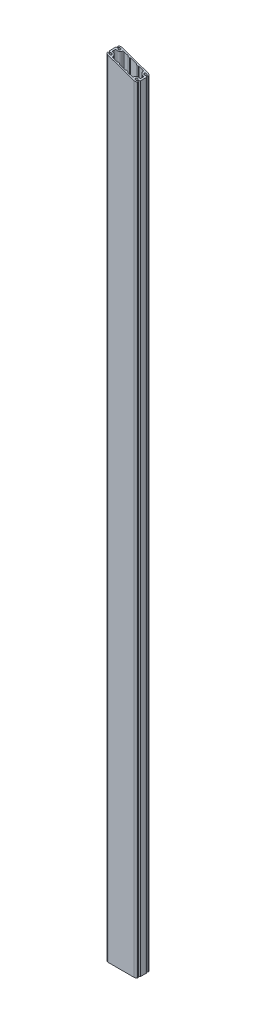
ISO-10303-21;
HEADER;
FILE_DESCRIPTION(('STEP AP214'),'2;1');
FILE_NAME('part.step','',(''),(''),'','','');
FILE_SCHEMA(('AUTOMOTIVE_DESIGN { 1 0 10303 214 1 1 1 1 }'));
ENDSEC;
DATA;
#1=APPLICATION_CONTEXT('core data for automotive mechanical design processes');
#2=APPLICATION_PROTOCOL_DEFINITION('international standard','automotive_design',2000,#1);
#3=PRODUCT_CONTEXT('',#1,'mechanical');
#4=PRODUCT('Part','Part','',(#3));
#5=PRODUCT_RELATED_PRODUCT_CATEGORY('part','',(#4));
#6=PRODUCT_DEFINITION_FORMATION('','',#4);
#7=PRODUCT_DEFINITION_CONTEXT('part definition',#1,'design');
#8=PRODUCT_DEFINITION('design','',#6,#7);
#9=PRODUCT_DEFINITION_SHAPE('','',#8);
#10=(LENGTH_UNIT() NAMED_UNIT(*) SI_UNIT(.MILLI.,.METRE.));
#11=(NAMED_UNIT(*) PLANE_ANGLE_UNIT() SI_UNIT($,.RADIAN.));
#12=(NAMED_UNIT(*) SI_UNIT($,.STERADIAN.) SOLID_ANGLE_UNIT());
#13=UNCERTAINTY_MEASURE_WITH_UNIT(LENGTH_MEASURE(1.E-05),#10,'distance_accuracy_value','');
#14=(GEOMETRIC_REPRESENTATION_CONTEXT(3) GLOBAL_UNCERTAINTY_ASSIGNED_CONTEXT((#13)) GLOBAL_UNIT_ASSIGNED_CONTEXT((#10,
#11,#12)) REPRESENTATION_CONTEXT('',''));
#15=CARTESIAN_POINT('',(0.,0.,0.));
#16=DIRECTION('',(0.,0.,1.));
#17=DIRECTION('',(1.,0.,0.));
#18=AXIS2_PLACEMENT_3D('',#15,#16,#17);
#19=CARTESIAN_POINT('',(84.6938611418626,0.,-30.5717765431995));
#20=DIRECTION('',(0.,1.,0.));
#21=DIRECTION('',(0.,0.,1.));
#22=AXIS2_PLACEMENT_3D('',#19,#20,#21);
#23=PLANE('',#22);
#24=CARTESIAN_POINT('',(84.6938611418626,0.,-30.5717765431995));
#25=DIRECTION('',(0.,1.,0.));
#26=DIRECTION('',(0.,0.,1.));
#27=AXIS2_PLACEMENT_3D('',#24,#25,#26);
#28=CIRCLE('',#27,3.99999999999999);
#29=CARTESIAN_POINT('',(81.1914378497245,0.,-28.6396711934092));
#30=VERTEX_POINT('',#29);
#31=CARTESIAN_POINT('',(88.1962844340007,0.,-32.5038818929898));
#32=VERTEX_POINT('',#31);
#33=EDGE_CURVE('E408',#30,#32,#28,.T.);
#34=ORIENTED_EDGE('',*,*,#33,.F.);
#35=CARTESIAN_POINT('',(75.5,0.,-25.5));
#36=DIRECTION('',(0.,-1.,0.));
#37=DIRECTION('',(0.,0.,1.));
#38=AXIS2_PLACEMENT_3D('',#35,#36,#37);
#39=CIRCLE('',#38,6.5);
#40=CARTESIAN_POINT('',(79.7220192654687,0.,-20.5578796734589));
#41=VERTEX_POINT('',#40);
#42=EDGE_CURVE('E395',#41,#30,#39,.T.);
#43=ORIENTED_EDGE('',*,*,#42,.F.);
#44=CARTESIAN_POINT('',(83.7691890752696,0.,-15.8204308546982));
#45=DIRECTION('',(0.,1.,0.));
#46=DIRECTION('',(0.,0.,1.));
#47=AXIS2_PLACEMENT_3D('',#44,#45,#46);
#48=CIRCLE('',#47,6.23081092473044);
#49=CARTESIAN_POINT('',(90.,0.,-15.8204308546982));
#50=VERTEX_POINT('',#49);
#51=EDGE_CURVE('E402',#50,#41,#48,.T.);
#52=ORIENTED_EDGE('',*,*,#51,.F.);
#53=DIRECTION('',(0.,0.,-1.));
#54=VECTOR('',#53,1.);
#55=CARTESIAN_POINT('',(90.,0.,15.8204308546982));
#56=LINE('',#55,#54);
#57=CARTESIAN_POINT('',(90.,0.,15.8204308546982));
#58=VERTEX_POINT('',#57);
#59=EDGE_CURVE('E473',#58,#50,#56,.T.);
#60=ORIENTED_EDGE('',*,*,#59,.F.);
#61=CARTESIAN_POINT('',(83.7691890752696,0.,15.8204308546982));
#62=DIRECTION('',(0.,1.,0.));
#63=DIRECTION('',(0.,0.,-1.));
#64=AXIS2_PLACEMENT_3D('',#61,#62,#63);
#65=CIRCLE('',#64,6.23081092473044);
#66=CARTESIAN_POINT('',(79.7220192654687,0.,20.5578796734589));
#67=VERTEX_POINT('',#66);
#68=EDGE_CURVE('E469',#67,#58,#65,.T.);
#69=ORIENTED_EDGE('',*,*,#68,.F.);
#70=CARTESIAN_POINT('',(75.5,0.,25.5));
#71=DIRECTION('',(0.,-1.,0.));
#72=DIRECTION('',(0.,0.,-1.));
#73=AXIS2_PLACEMENT_3D('',#70,#71,#72);
#74=CIRCLE('',#73,6.5);
#75=CARTESIAN_POINT('',(81.1914378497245,0.,28.6396711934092));
#76=VERTEX_POINT('',#75);
#77=EDGE_CURVE('E465',#76,#67,#74,.T.);
#78=ORIENTED_EDGE('',*,*,#77,.F.);
#79=CARTESIAN_POINT('',(84.6938611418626,0.,30.5717765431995));
#80=DIRECTION('',(0.,1.,0.));
#81=DIRECTION('',(0.,0.,-1.));
#82=AXIS2_PLACEMENT_3D('',#79,#80,#81);
#83=CIRCLE('',#82,3.99999999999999);
#84=CARTESIAN_POINT('',(88.1962844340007,0.,32.5038818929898));
#85=VERTEX_POINT('',#84);
#86=EDGE_CURVE('E461',#85,#76,#83,.T.);
#87=ORIENTED_EDGE('',*,*,#86,.F.);
#88=CARTESIAN_POINT('',(75.5,0.,25.5));
#89=DIRECTION('',(0.,1.,0.));
#90=DIRECTION('',(0.,0.,-1.));
#91=AXIS2_PLACEMENT_3D('',#88,#89,#90);
#92=CIRCLE('',#91,14.5);
#93=CARTESIAN_POINT('',(75.5,0.,40.));
#94=VERTEX_POINT('',#93);
#95=EDGE_CURVE('E457',#94,#85,#92,.T.);
#96=ORIENTED_EDGE('',*,*,#95,.F.);
#97=DIRECTION('',(1.,0.,0.));
#98=VECTOR('',#97,1.);
#99=CARTESIAN_POINT('',(75.5,0.,40.));
#100=LINE('',#99,#98);
#101=CARTESIAN_POINT('',(-75.5,0.,40.));
#102=VERTEX_POINT('',#101);
#103=EDGE_CURVE('E453',#102,#94,#100,.T.);
#104=ORIENTED_EDGE('',*,*,#103,.F.);
#105=CARTESIAN_POINT('',(-75.5,0.,25.5));
#106=DIRECTION('',(0.,1.,0.));
#107=DIRECTION('',(0.,0.,1.));
#108=AXIS2_PLACEMENT_3D('',#105,#106,#107);
#109=CIRCLE('',#108,14.5);
#110=CARTESIAN_POINT('',(-88.1962844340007,0.,32.5038818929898));
#111=VERTEX_POINT('',#110);
#112=EDGE_CURVE('E449',#111,#102,#109,.T.);
#113=ORIENTED_EDGE('',*,*,#112,.F.);
#114=CARTESIAN_POINT('',(-84.6938611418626,0.,30.5717765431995));
#115=DIRECTION('',(0.,1.,0.));
#116=DIRECTION('',(0.,0.,1.));
#117=AXIS2_PLACEMENT_3D('',#114,#115,#116);
#118=CIRCLE('',#117,3.99999999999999);
#119=CARTESIAN_POINT('',(-81.1914378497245,0.,28.6396711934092));
#120=VERTEX_POINT('',#119);
#121=EDGE_CURVE('E445',#120,#111,#118,.T.);
#122=ORIENTED_EDGE('',*,*,#121,.F.);
#123=CARTESIAN_POINT('',(-75.5,0.,25.5));
#124=DIRECTION('',(0.,-1.,0.));
#125=DIRECTION('',(0.,0.,1.));
#126=AXIS2_PLACEMENT_3D('',#123,#124,#125);
#127=CIRCLE('',#126,6.5);
#128=CARTESIAN_POINT('',(-79.7220192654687,0.,20.5578796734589));
#129=VERTEX_POINT('',#128);
#130=EDGE_CURVE('E441',#129,#120,#127,.T.);
#131=ORIENTED_EDGE('',*,*,#130,.F.);
#132=CARTESIAN_POINT('',(-83.7691890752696,0.,15.8204308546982));
#133=DIRECTION('',(0.,1.,0.));
#134=DIRECTION('',(0.,0.,1.));
#135=AXIS2_PLACEMENT_3D('',#132,#133,#134);
#136=CIRCLE('',#135,6.23081092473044);
#137=CARTESIAN_POINT('',(-90.,0.,15.8204308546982));
#138=VERTEX_POINT('',#137);
#139=EDGE_CURVE('E437',#138,#129,#136,.T.);
#140=ORIENTED_EDGE('',*,*,#139,.F.);
#141=DIRECTION('',(0.,0.,1.));
#142=VECTOR('',#141,1.);
#143=CARTESIAN_POINT('',(-90.,0.,15.8204308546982));
#144=LINE('',#143,#142);
#145=CARTESIAN_POINT('',(-90.,0.,-15.8204308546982));
#146=VERTEX_POINT('',#145);
#147=EDGE_CURVE('E434',#146,#138,#144,.T.);
#148=ORIENTED_EDGE('',*,*,#147,.F.);
#149=CARTESIAN_POINT('',(-83.7691890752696,0.,-15.8204308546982));
#150=DIRECTION('',(0.,1.,0.));
#151=DIRECTION('',(0.,0.,-1.));
#152=AXIS2_PLACEMENT_3D('',#149,#150,#151);
#153=CIRCLE('',#152,6.23081092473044);
#154=CARTESIAN_POINT('',(-79.7220192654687,0.,-20.5578796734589));
#155=VERTEX_POINT('',#154);
#156=EDGE_CURVE('E383',#155,#146,#153,.T.);
#157=ORIENTED_EDGE('',*,*,#156,.F.);
#158=CARTESIAN_POINT('',(-75.5,0.,-25.5));
#159=DIRECTION('',(0.,-1.,0.));
#160=DIRECTION('',(0.,0.,-1.));
#161=AXIS2_PLACEMENT_3D('',#158,#159,#160);
#162=CIRCLE('',#161,6.5);
#163=CARTESIAN_POINT('',(-81.1914378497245,0.,-28.6396711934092));
#164=VERTEX_POINT('',#163);
#165=EDGE_CURVE('E428',#164,#155,#162,.T.);
#166=ORIENTED_EDGE('',*,*,#165,.F.);
#167=CARTESIAN_POINT('',(-84.6938611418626,0.,-30.5717765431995));
#168=DIRECTION('',(0.,1.,0.));
#169=DIRECTION('',(0.,0.,-1.));
#170=AXIS2_PLACEMENT_3D('',#167,#168,#169);
#171=CIRCLE('',#170,3.99999999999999);
#172=CARTESIAN_POINT('',(-88.1962844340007,0.,-32.5038818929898));
#173=VERTEX_POINT('',#172);
#174=EDGE_CURVE('E424',#173,#164,#171,.T.);
#175=ORIENTED_EDGE('',*,*,#174,.F.);
#176=CARTESIAN_POINT('',(-75.5,0.,-25.5));
#177=DIRECTION('',(0.,1.,0.));
#178=DIRECTION('',(0.,0.,-1.));
#179=AXIS2_PLACEMENT_3D('',#176,#177,#178);
#180=CIRCLE('',#179,14.5);
#181=CARTESIAN_POINT('',(-75.5,0.,-40.));
#182=VERTEX_POINT('',#181);
#183=EDGE_CURVE('E420',#182,#173,#180,.T.);
#184=ORIENTED_EDGE('',*,*,#183,.F.);
#185=DIRECTION('',(-1.,0.,0.));
#186=VECTOR('',#185,1.);
#187=CARTESIAN_POINT('',(75.5,0.,-40.));
#188=LINE('',#187,#186);
#189=CARTESIAN_POINT('',(75.5,0.,-40.));
#190=VERTEX_POINT('',#189);
#191=EDGE_CURVE('E416',#190,#182,#188,.T.);
#192=ORIENTED_EDGE('',*,*,#191,.F.);
#193=CARTESIAN_POINT('',(75.5,0.,-25.5));
#194=DIRECTION('',(0.,1.,0.));
#195=DIRECTION('',(0.,0.,1.));
#196=AXIS2_PLACEMENT_3D('',#193,#194,#195);
#197=CIRCLE('',#196,14.5);
#198=EDGE_CURVE('E412',#32,#190,#197,.T.);
#199=ORIENTED_EDGE('',*,*,#198,.F.);
#200=EDGE_LOOP('',(#34,#43,#52,#60,#69,#78,#87,#96,#104,#113,#122,#131,#140,#148,#157,#166,#175,
#184,#192,#199));
#201=FACE_BOUND('',#200,.T.);
#202=CARTESIAN_POINT('',(75.5,0.,-25.5));
#203=DIRECTION('',(0.,-1.,0.));
#204=DIRECTION('',(0.,0.,1.));
#205=AXIS2_PLACEMENT_3D('',#202,#203,#204);
#206=CIRCLE('',#205,14.5);
#207=CARTESIAN_POINT('',(75.5,0.,-11.));
#208=VERTEX_POINT('',#207);
#209=CARTESIAN_POINT('',(61.,0.,-25.5));
#210=VERTEX_POINT('',#209);
#211=EDGE_CURVE('E623',#208,#210,#206,.T.);
#212=ORIENTED_EDGE('',*,*,#211,.T.);
#213=CARTESIAN_POINT('',(54.5,0.,-25.5));
#214=DIRECTION('',(0.,1.,0.));
#215=DIRECTION('',(0.,0.,1.));
#216=AXIS2_PLACEMENT_3D('',#213,#214,#215);
#217=CIRCLE('',#216,6.5);
#218=CARTESIAN_POINT('',(54.5,0.,-32.));
#219=VERTEX_POINT('',#218);
#220=EDGE_CURVE('E627',#210,#219,#217,.T.);
#221=ORIENTED_EDGE('',*,*,#220,.T.);
#222=DIRECTION('',(-1.,0.,0.));
#223=VECTOR('',#222,1.);
#224=CARTESIAN_POINT('',(32.5172988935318,0.,-32.));
#225=LINE('',#224,#223);
#226=CARTESIAN_POINT('',(32.5172988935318,0.,-32.));
#227=VERTEX_POINT('',#226);
#228=EDGE_CURVE('E631',#219,#227,#225,.T.);
#229=ORIENTED_EDGE('',*,*,#228,.T.);
#230=DIRECTION('',(-0.642787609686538,0.,0.766044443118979));
#231=VECTOR('',#230,1.);
#232=CARTESIAN_POINT('',(30.,0.,-29.));
#233=LINE('',#232,#231);
#234=CARTESIAN_POINT('',(30.,0.,-29.));
#235=VERTEX_POINT('',#234);
#236=EDGE_CURVE('E635',#227,#235,#233,.T.);
#237=ORIENTED_EDGE('',*,*,#236,.T.);
#238=DIRECTION('',(-1.,0.,0.));
#239=VECTOR('',#238,1.);
#240=CARTESIAN_POINT('',(20.,0.,-29.));
#241=LINE('',#240,#239);
#242=CARTESIAN_POINT('',(20.,0.,-29.));
#243=VERTEX_POINT('',#242);
#244=EDGE_CURVE('E639',#235,#243,#241,.T.);
#245=ORIENTED_EDGE('',*,*,#244,.T.);
#246=DIRECTION('',(-0.642787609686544,0.,-0.766044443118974));
#247=VECTOR('',#246,1.);
#248=CARTESIAN_POINT('',(20.,0.,-29.));
#249=LINE('',#248,#247);
#250=CARTESIAN_POINT('',(17.4827011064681,0.,-32.));
#251=VERTEX_POINT('',#250);
#252=EDGE_CURVE('E643',#243,#251,#249,.T.);
#253=ORIENTED_EDGE('',*,*,#252,.T.);
#254=DIRECTION('',(-1.,0.,0.));
#255=VECTOR('',#254,1.);
#256=CARTESIAN_POINT('',(-17.4827011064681,0.,-32.));
#257=LINE('',#256,#255);
#258=CARTESIAN_POINT('',(-17.4827011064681,0.,-32.));
#259=VERTEX_POINT('',#258);
#260=EDGE_CURVE('E647',#251,#259,#257,.T.);
#261=ORIENTED_EDGE('',*,*,#260,.T.);
#262=DIRECTION('',(-0.642787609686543,0.,0.766044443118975));
#263=VECTOR('',#262,1.);
#264=CARTESIAN_POINT('',(-20.,0.,-29.));
#265=LINE('',#264,#263);
#266=CARTESIAN_POINT('',(-20.,0.,-29.));
#267=VERTEX_POINT('',#266);
#268=EDGE_CURVE('E651',#259,#267,#265,.T.);
#269=ORIENTED_EDGE('',*,*,#268,.T.);
#270=DIRECTION('',(-1.,0.,0.));
#271=VECTOR('',#270,1.);
#272=CARTESIAN_POINT('',(-20.,0.,-29.));
#273=LINE('',#272,#271);
#274=CARTESIAN_POINT('',(-30.,0.,-29.));
#275=VERTEX_POINT('',#274);
#276=EDGE_CURVE('E655',#267,#275,#273,.T.);
#277=ORIENTED_EDGE('',*,*,#276,.T.);
#278=DIRECTION('',(-0.642787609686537,0.,-0.76604444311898));
#279=VECTOR('',#278,1.);
#280=CARTESIAN_POINT('',(-30.,0.,-29.));
#281=LINE('',#280,#279);
#282=CARTESIAN_POINT('',(-32.5172988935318,0.,-32.));
#283=VERTEX_POINT('',#282);
#284=EDGE_CURVE('E659',#275,#283,#281,.T.);
#285=ORIENTED_EDGE('',*,*,#284,.T.);
#286=DIRECTION('',(-1.,0.,0.));
#287=VECTOR('',#286,1.);
#288=CARTESIAN_POINT('',(-32.5172988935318,0.,-32.));
#289=LINE('',#288,#287);
#290=CARTESIAN_POINT('',(-54.5,0.,-32.));
#291=VERTEX_POINT('',#290);
#292=EDGE_CURVE('E663',#283,#291,#289,.T.);
#293=ORIENTED_EDGE('',*,*,#292,.T.);
#294=CARTESIAN_POINT('',(-54.5,0.,-25.5));
#295=DIRECTION('',(0.,1.,0.));
#296=DIRECTION('',(0.,0.,-1.));
#297=AXIS2_PLACEMENT_3D('',#294,#295,#296);
#298=CIRCLE('',#297,6.5);
#299=CARTESIAN_POINT('',(-61.,0.,-25.5));
#300=VERTEX_POINT('',#299);
#301=EDGE_CURVE('E667',#291,#300,#298,.T.);
#302=ORIENTED_EDGE('',*,*,#301,.T.);
#303=CARTESIAN_POINT('',(-75.5,0.,-25.5));
#304=DIRECTION('',(0.,-1.,0.));
#305=DIRECTION('',(0.,0.,-1.));
#306=AXIS2_PLACEMENT_3D('',#303,#304,#305);
#307=CIRCLE('',#306,14.5);
#308=CARTESIAN_POINT('',(-75.5,0.,-11.));
#309=VERTEX_POINT('',#308);
#310=EDGE_CURVE('E671',#300,#309,#307,.T.);
#311=ORIENTED_EDGE('',*,*,#310,.T.);
#312=CARTESIAN_POINT('',(-75.5,0.,-4.5));
#313=DIRECTION('',(0.,1.,0.));
#314=DIRECTION('',(0.,0.,-1.));
#315=AXIS2_PLACEMENT_3D('',#312,#313,#314);
#316=CIRCLE('',#315,6.5);
#317=CARTESIAN_POINT('',(-82.,0.,-4.5));
#318=VERTEX_POINT('',#317);
#319=EDGE_CURVE('E675',#309,#318,#316,.T.);
#320=ORIENTED_EDGE('',*,*,#319,.T.);
#321=DIRECTION('',(0.,0.,1.));
#322=VECTOR('',#321,1.);
#323=CARTESIAN_POINT('',(-82.,0.,-4.5));
#324=LINE('',#323,#322);
#325=CARTESIAN_POINT('',(-82.,0.,4.5));
#326=VERTEX_POINT('',#325);
#327=EDGE_CURVE('E679',#318,#326,#324,.T.);
#328=ORIENTED_EDGE('',*,*,#327,.T.);
#329=CARTESIAN_POINT('',(-75.5,0.,4.5));
#330=DIRECTION('',(0.,1.,0.));
#331=DIRECTION('',(0.,0.,1.));
#332=AXIS2_PLACEMENT_3D('',#329,#330,#331);
#333=CIRCLE('',#332,6.5);
#334=CARTESIAN_POINT('',(-75.5,0.,11.));
#335=VERTEX_POINT('',#334);
#336=EDGE_CURVE('E683',#326,#335,#333,.T.);
#337=ORIENTED_EDGE('',*,*,#336,.T.);
#338=CARTESIAN_POINT('',(-75.5,0.,25.5));
#339=DIRECTION('',(0.,-1.,0.));
#340=DIRECTION('',(0.,0.,1.));
#341=AXIS2_PLACEMENT_3D('',#338,#339,#340);
#342=CIRCLE('',#341,14.5);
#343=CARTESIAN_POINT('',(-61.,0.,25.5));
#344=VERTEX_POINT('',#343);
#345=EDGE_CURVE('E687',#335,#344,#342,.T.);
#346=ORIENTED_EDGE('',*,*,#345,.T.);
#347=CARTESIAN_POINT('',(-54.5,0.,25.5));
#348=DIRECTION('',(0.,1.,0.));
#349=DIRECTION('',(0.,0.,1.));
#350=AXIS2_PLACEMENT_3D('',#347,#348,#349);
#351=CIRCLE('',#350,6.5);
#352=CARTESIAN_POINT('',(-54.5,0.,32.));
#353=VERTEX_POINT('',#352);
#354=EDGE_CURVE('E691',#344,#353,#351,.T.);
#355=ORIENTED_EDGE('',*,*,#354,.T.);
#356=DIRECTION('',(1.,0.,0.));
#357=VECTOR('',#356,1.);
#358=CARTESIAN_POINT('',(-32.5172988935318,0.,32.));
#359=LINE('',#358,#357);
#360=CARTESIAN_POINT('',(-32.5172988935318,0.,32.));
#361=VERTEX_POINT('',#360);
#362=EDGE_CURVE('E695',#353,#361,#359,.T.);
#363=ORIENTED_EDGE('',*,*,#362,.T.);
#364=DIRECTION('',(0.642787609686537,0.,-0.76604444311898));
#365=VECTOR('',#364,1.);
#366=CARTESIAN_POINT('',(-30.,0.,29.));
#367=LINE('',#366,#365);
#368=CARTESIAN_POINT('',(-30.,0.,29.));
#369=VERTEX_POINT('',#368);
#370=EDGE_CURVE('E699',#361,#369,#367,.T.);
#371=ORIENTED_EDGE('',*,*,#370,.T.);
#372=DIRECTION('',(1.,0.,0.));
#373=VECTOR('',#372,1.);
#374=CARTESIAN_POINT('',(-20.,0.,29.));
#375=LINE('',#374,#373);
#376=CARTESIAN_POINT('',(-20.,0.,29.));
#377=VERTEX_POINT('',#376);
#378=EDGE_CURVE('E703',#369,#377,#375,.T.);
#379=ORIENTED_EDGE('',*,*,#378,.T.);
#380=DIRECTION('',(0.642787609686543,0.,0.766044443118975));
#381=VECTOR('',#380,1.);
#382=CARTESIAN_POINT('',(-20.,0.,29.));
#383=LINE('',#382,#381);
#384=CARTESIAN_POINT('',(-17.4827011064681,0.,32.));
#385=VERTEX_POINT('',#384);
#386=EDGE_CURVE('E707',#377,#385,#383,.T.);
#387=ORIENTED_EDGE('',*,*,#386,.T.);
#388=DIRECTION('',(1.,0.,0.));
#389=VECTOR('',#388,1.);
#390=CARTESIAN_POINT('',(-17.4827011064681,0.,32.));
#391=LINE('',#390,#389);
#392=CARTESIAN_POINT('',(17.4827011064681,0.,32.));
#393=VERTEX_POINT('',#392);
#394=EDGE_CURVE('E711',#385,#393,#391,.T.);
#395=ORIENTED_EDGE('',*,*,#394,.T.);
#396=DIRECTION('',(0.642787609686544,0.,-0.766044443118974));
#397=VECTOR('',#396,1.);
#398=CARTESIAN_POINT('',(20.,0.,29.));
#399=LINE('',#398,#397);
#400=CARTESIAN_POINT('',(20.,0.,29.));
#401=VERTEX_POINT('',#400);
#402=EDGE_CURVE('E715',#393,#401,#399,.T.);
#403=ORIENTED_EDGE('',*,*,#402,.T.);
#404=DIRECTION('',(1.,0.,0.));
#405=VECTOR('',#404,1.);
#406=CARTESIAN_POINT('',(20.,0.,29.));
#407=LINE('',#406,#405);
#408=CARTESIAN_POINT('',(30.,0.,29.));
#409=VERTEX_POINT('',#408);
#410=EDGE_CURVE('E719',#401,#409,#407,.T.);
#411=ORIENTED_EDGE('',*,*,#410,.T.);
#412=DIRECTION('',(0.642787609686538,0.,0.766044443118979));
#413=VECTOR('',#412,1.);
#414=CARTESIAN_POINT('',(30.,0.,29.));
#415=LINE('',#414,#413);
#416=CARTESIAN_POINT('',(32.5172988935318,0.,32.));
#417=VERTEX_POINT('',#416);
#418=EDGE_CURVE('E723',#409,#417,#415,.T.);
#419=ORIENTED_EDGE('',*,*,#418,.T.);
#420=DIRECTION('',(1.,0.,0.));
#421=VECTOR('',#420,1.);
#422=CARTESIAN_POINT('',(32.5172988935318,0.,32.));
#423=LINE('',#422,#421);
#424=CARTESIAN_POINT('',(54.5,0.,32.));
#425=VERTEX_POINT('',#424);
#426=EDGE_CURVE('E727',#417,#425,#423,.T.);
#427=ORIENTED_EDGE('',*,*,#426,.T.);
#428=CARTESIAN_POINT('',(54.5,0.,25.5));
#429=DIRECTION('',(0.,1.,0.));
#430=DIRECTION('',(0.,0.,-1.));
#431=AXIS2_PLACEMENT_3D('',#428,#429,#430);
#432=CIRCLE('',#431,6.5);
#433=CARTESIAN_POINT('',(61.,0.,25.5));
#434=VERTEX_POINT('',#433);
#435=EDGE_CURVE('E731',#425,#434,#432,.T.);
#436=ORIENTED_EDGE('',*,*,#435,.T.);
#437=CARTESIAN_POINT('',(75.5,0.,25.5));
#438=DIRECTION('',(0.,-1.,0.));
#439=DIRECTION('',(0.,0.,-1.));
#440=AXIS2_PLACEMENT_3D('',#437,#438,#439);
#441=CIRCLE('',#440,14.5);
#442=CARTESIAN_POINT('',(75.5,0.,11.));
#443=VERTEX_POINT('',#442);
#444=EDGE_CURVE('E735',#434,#443,#441,.T.);
#445=ORIENTED_EDGE('',*,*,#444,.T.);
#446=CARTESIAN_POINT('',(75.5,0.,4.5));
#447=DIRECTION('',(0.,1.,0.));
#448=DIRECTION('',(0.,0.,-1.));
#449=AXIS2_PLACEMENT_3D('',#446,#447,#448);
#450=CIRCLE('',#449,6.5);
#451=CARTESIAN_POINT('',(82.,0.,4.5));
#452=VERTEX_POINT('',#451);
#453=EDGE_CURVE('E739',#443,#452,#450,.T.);
#454=ORIENTED_EDGE('',*,*,#453,.T.);
#455=DIRECTION('',(0.,0.,-1.));
#456=VECTOR('',#455,1.);
#457=CARTESIAN_POINT('',(82.,0.,-4.5));
#458=LINE('',#457,#456);
#459=CARTESIAN_POINT('',(82.,0.,-4.5));
#460=VERTEX_POINT('',#459);
#461=EDGE_CURVE('E743',#452,#460,#458,.T.);
#462=ORIENTED_EDGE('',*,*,#461,.T.);
#463=CARTESIAN_POINT('',(75.5,0.,-4.5));
#464=DIRECTION('',(0.,1.,0.));
#465=DIRECTION('',(0.,0.,1.));
#466=AXIS2_PLACEMENT_3D('',#463,#464,#465);
#467=CIRCLE('',#466,6.5);
#468=EDGE_CURVE('E747',#460,#208,#467,.T.);
#469=ORIENTED_EDGE('',*,*,#468,.T.);
#470=EDGE_LOOP('',(#212,#221,#229,#237,#245,#253,#261,#269,#277,#285,#293,#302,#311,#320,#328,
#337,#346,#355,#363,#371,#379,#387,#395,#403,#411,#419,#427,#436,#445,#454,#462,#469));
#471=FACE_BOUND('',#470,.T.);
#472=ADVANCED_FACE('F39',(#201,#471),#23,.F.);
#473=CARTESIAN_POINT('',(84.6938611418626,4584.8,-30.5717765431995));
#474=DIRECTION('',(0.,-1.,0.));
#475=DIRECTION('',(0.,0.,-1.));
#476=AXIS2_PLACEMENT_3D('',#473,#474,#475);
#477=CYLINDRICAL_SURFACE('',#476,3.99999999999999);
#478=DIRECTION('',(0.,-1.,0.));
#479=VECTOR('',#478,1.);
#480=CARTESIAN_POINT('',(88.1962844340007,4584.8,-32.5038818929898));
#481=LINE('',#480,#479);
#482=CARTESIAN_POINT('',(88.1962844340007,4523.02528816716,-32.5038818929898));
#483=VERTEX_POINT('',#482);
#484=EDGE_CURVE('E48',#483,#32,#481,.T.);
#485=ORIENTED_EDGE('',*,*,#484,.F.);
#486=CARTESIAN_POINT('',(84.6938611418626,4524.23946157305,-30.5717765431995));
#487=DIRECTION('',(-0.327543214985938,-0.944836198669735,0.));
#488=DIRECTION('',(0.944836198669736,-0.327543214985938,0.));
#489=AXIS2_PLACEMENT_3D('',#486,#487,#488);
#490=ELLIPSE('',#489,4.23353805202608,3.99999999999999);
#491=CARTESIAN_POINT('',(81.1914378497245,4525.45363497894,-28.6396711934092));
#492=VERTEX_POINT('',#491);
#493=EDGE_CURVE('E544',#483,#492,#490,.T.);
#494=ORIENTED_EDGE('',*,*,#493,.T.);
#495=DIRECTION('',(0.,-1.,0.));
#496=VECTOR('',#495,1.);
#497=CARTESIAN_POINT('',(81.1914378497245,4584.8,-28.6396711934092));
#498=LINE('',#497,#496);
#499=EDGE_CURVE('E394',#492,#30,#498,.T.);
#500=ORIENTED_EDGE('',*,*,#499,.T.);
#501=ORIENTED_EDGE('',*,*,#33,.T.);
#502=EDGE_LOOP('',(#485,#494,#500,#501));
#503=FACE_BOUND('',#502,.T.);
#504=ADVANCED_FACE('F41',(#503),#477,.T.);
#505=CARTESIAN_POINT('',(75.5,4584.8,-25.5));
#506=DIRECTION('',(0.,-1.,0.));
#507=DIRECTION('',(0.,0.,-1.));
#508=AXIS2_PLACEMENT_3D('',#505,#506,#507);
#509=CYLINDRICAL_SURFACE('',#508,14.5);
#510=DIRECTION('',(0.,-1.,0.));
#511=VECTOR('',#510,1.);
#512=CARTESIAN_POINT('',(75.5,4584.8,-40.));
#513=LINE('',#512,#511);
#514=CARTESIAN_POINT('',(75.4999999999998,4527.42666676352,-40.));
#515=VERTEX_POINT('',#514);
#516=EDGE_CURVE('E525',#515,#190,#513,.T.);
#517=ORIENTED_EDGE('',*,*,#516,.F.);
#518=CARTESIAN_POINT('',(75.5,4527.42666676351,-25.5));
#519=DIRECTION('',(-0.327543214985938,-0.944836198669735,0.));
#520=DIRECTION('',(0.944836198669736,-0.327543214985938,0.));
#521=AXIS2_PLACEMENT_3D('',#518,#519,#520);
#522=ELLIPSE('',#521,15.3465754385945,14.5);
#523=EDGE_CURVE('E535',#515,#483,#522,.T.);
#524=ORIENTED_EDGE('',*,*,#523,.T.);
#525=ORIENTED_EDGE('',*,*,#484,.T.);
#526=ORIENTED_EDGE('',*,*,#198,.T.);
#527=EDGE_LOOP('',(#517,#524,#525,#526));
#528=FACE_BOUND('',#527,.T.);
#529=ADVANCED_FACE('F533',(#528),#509,.T.);
#530=CARTESIAN_POINT('',(75.5,4584.8,-40.));
#531=DIRECTION('',(0.,0.,1.));
#532=DIRECTION('',(1.,0.,0.));
#533=AXIS2_PLACEMENT_3D('',#530,#531,#532);
#534=PLANE('',#533);
#535=DIRECTION('',(0.,-1.,0.));
#536=VECTOR('',#535,1.);
#537=CARTESIAN_POINT('',(-75.5,4584.8,-40.));
#538=LINE('',#537,#536);
#539=CARTESIAN_POINT('',(-75.5,4579.77333334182,-40.));
#540=VERTEX_POINT('',#539);
#541=EDGE_CURVE('E522',#540,#182,#538,.T.);
#542=ORIENTED_EDGE('',*,*,#541,.F.);
#543=DIRECTION('',(0.944836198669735,-0.327543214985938,0.));
#544=VECTOR('',#543,1.);
#545=CARTESIAN_POINT('',(90.,4522.40000010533,-40.));
#546=LINE('',#545,#544);
#547=EDGE_CURVE('E872',#540,#515,#546,.T.);
#548=ORIENTED_EDGE('',*,*,#547,.T.);
#549=ORIENTED_EDGE('',*,*,#516,.T.);
#550=ORIENTED_EDGE('',*,*,#191,.T.);
#551=EDGE_LOOP('',(#542,#548,#549,#550));
#552=FACE_BOUND('',#551,.T.);
#553=ADVANCED_FACE('F988',(#552),#534,.F.);
#554=CARTESIAN_POINT('',(-75.5,4584.8,-25.5));
#555=DIRECTION('',(0.,-1.,0.));
#556=DIRECTION('',(0.,0.,-1.));
#557=AXIS2_PLACEMENT_3D('',#554,#555,#556);
#558=CYLINDRICAL_SURFACE('',#557,14.5);
#559=DIRECTION('',(0.,-1.,0.));
#560=VECTOR('',#559,1.);
#561=CARTESIAN_POINT('',(-88.1962844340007,4584.8,-32.5038818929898));
#562=LINE('',#561,#560);
#563=CARTESIAN_POINT('',(-88.1962844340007,4584.17471193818,-32.5038818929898));
#564=VERTEX_POINT('',#563);
#565=EDGE_CURVE('E519',#564,#173,#562,.T.);
#566=ORIENTED_EDGE('',*,*,#565,.F.);
#567=CARTESIAN_POINT('',(-75.5,4579.77333334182,-25.5));
#568=DIRECTION('',(-0.327543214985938,-0.944836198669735,0.));
#569=DIRECTION('',(0.944836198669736,-0.327543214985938,0.));
#570=AXIS2_PLACEMENT_3D('',#567,#568,#569);
#571=ELLIPSE('',#570,15.3465754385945,14.5);
#572=EDGE_CURVE('E619',#564,#540,#571,.T.);
#573=ORIENTED_EDGE('',*,*,#572,.T.);
#574=ORIENTED_EDGE('',*,*,#541,.T.);
#575=ORIENTED_EDGE('',*,*,#183,.T.);
#576=EDGE_LOOP('',(#566,#573,#574,#575));
#577=FACE_BOUND('',#576,.T.);
#578=ADVANCED_FACE('F991',(#577),#558,.T.);
#579=CARTESIAN_POINT('',(-84.6938611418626,4584.8,-30.5717765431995));
#580=DIRECTION('',(0.,-1.,0.));
#581=DIRECTION('',(0.,0.,-1.));
#582=AXIS2_PLACEMENT_3D('',#579,#580,#581);
#583=CYLINDRICAL_SURFACE('',#582,3.99999999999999);
#584=DIRECTION('',(0.,-1.,0.));
#585=VECTOR('',#584,1.);
#586=CARTESIAN_POINT('',(-81.1914378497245,4584.8,-28.6396711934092));
#587=LINE('',#586,#585);
#588=CARTESIAN_POINT('',(-81.1914378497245,4581.74636512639,-28.6396711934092));
#589=VERTEX_POINT('',#588);
#590=EDGE_CURVE('E516',#589,#164,#587,.T.);
#591=ORIENTED_EDGE('',*,*,#590,.F.);
#592=CARTESIAN_POINT('',(-84.6938611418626,4582.96053853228,-30.5717765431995));
#593=DIRECTION('',(-0.327543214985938,-0.944836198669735,0.));
#594=DIRECTION('',(0.944836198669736,-0.327543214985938,0.));
#595=AXIS2_PLACEMENT_3D('',#592,#593,#594);
#596=ELLIPSE('',#595,4.23353805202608,3.99999999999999);
#597=EDGE_CURVE('E615',#589,#564,#596,.T.);
#598=ORIENTED_EDGE('',*,*,#597,.T.);
#599=ORIENTED_EDGE('',*,*,#565,.T.);
#600=ORIENTED_EDGE('',*,*,#174,.T.);
#601=EDGE_LOOP('',(#591,#598,#599,#600));
#602=FACE_BOUND('',#601,.T.);
#603=ADVANCED_FACE('F995',(#602),#583,.T.);
#604=CARTESIAN_POINT('',(-75.5,4584.8,-25.5));
#605=DIRECTION('',(0.,-1.,0.));
#606=DIRECTION('',(0.,0.,-1.));
#607=AXIS2_PLACEMENT_3D('',#604,#605,#606);
#608=CYLINDRICAL_SURFACE('',#607,6.5);
#609=DIRECTION('',(0.,-1.,0.));
#610=VECTOR('',#609,1.);
#611=CARTESIAN_POINT('',(-79.7220192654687,4584.8,-20.5578796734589));
#612=LINE('',#611,#610);
#613=CARTESIAN_POINT('',(-79.7220192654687,4581.23696668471,-20.5578796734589));
#614=VERTEX_POINT('',#613);
#615=EDGE_CURVE('E387',#614,#155,#612,.T.);
#616=ORIENTED_EDGE('',*,*,#615,.F.);
#617=CARTESIAN_POINT('',(-75.5,4579.77333334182,-25.5));
#618=DIRECTION('',(-0.327543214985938,-0.944836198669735,0.));
#619=DIRECTION('',(0.944836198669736,-0.327543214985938,0.));
#620=AXIS2_PLACEMENT_3D('',#617,#618,#619);
#621=ELLIPSE('',#620,6.87949933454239,6.5);
#622=EDGE_CURVE('E373',#614,#589,#621,.F.);
#623=ORIENTED_EDGE('',*,*,#622,.T.);
#624=ORIENTED_EDGE('',*,*,#590,.T.);
#625=ORIENTED_EDGE('',*,*,#165,.T.);
#626=EDGE_LOOP('',(#616,#623,#624,#625));
#627=FACE_BOUND('',#626,.T.);
#628=ADVANCED_FACE('F998',(#627),#608,.F.);
#629=CARTESIAN_POINT('',(-83.7691890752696,4584.8,-15.8204308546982));
#630=DIRECTION('',(0.,-1.,0.));
#631=DIRECTION('',(0.,0.,-1.));
#632=AXIS2_PLACEMENT_3D('',#629,#630,#631);
#633=CYLINDRICAL_SURFACE('',#632,6.23081092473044);
#634=DIRECTION('',(0.,-1.,0.));
#635=VECTOR('',#634,1.);
#636=CARTESIAN_POINT('',(-90.,4584.8,-15.8204308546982));
#637=LINE('',#636,#635);
#638=CARTESIAN_POINT('',(-90.,4584.8,-15.8204308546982));
#639=VERTEX_POINT('',#638);
#640=EDGE_CURVE('E380',#639,#146,#637,.T.);
#641=ORIENTED_EDGE('',*,*,#640,.F.);
#642=CARTESIAN_POINT('',(-83.7691890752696,4582.63998554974,-15.8204308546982));
#643=DIRECTION('',(-0.327543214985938,-0.944836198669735,0.));
#644=DIRECTION('',(0.944836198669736,-0.327543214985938,0.));
#645=AXIS2_PLACEMENT_3D('',#642,#643,#644);
#646=ELLIPSE('',#645,6.59459378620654,6.23081092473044);
#647=EDGE_CURVE('E366',#639,#614,#646,.T.);
#648=ORIENTED_EDGE('',*,*,#647,.T.);
#649=ORIENTED_EDGE('',*,*,#615,.T.);
#650=ORIENTED_EDGE('',*,*,#156,.T.);
#651=EDGE_LOOP('',(#641,#648,#649,#650));
#652=FACE_BOUND('',#651,.T.);
#653=ADVANCED_FACE('F381',(#652),#633,.T.);
#654=CARTESIAN_POINT('',(-90.,4584.8,15.8204308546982));
#655=DIRECTION('',(1.,0.,0.));
#656=DIRECTION('',(0.,0.,-1.));
#657=AXIS2_PLACEMENT_3D('',#654,#655,#656);
#658=PLANE('',#657);
#659=ORIENTED_EDGE('',*,*,#147,.T.);
#660=DIRECTION('',(0.,-1.,0.));
#661=VECTOR('',#660,1.);
#662=CARTESIAN_POINT('',(-90.,4584.8,15.8204308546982));
#663=LINE('',#662,#661);
#664=CARTESIAN_POINT('',(-90.,4584.8,15.8204308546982));
#665=VERTEX_POINT('',#664);
#666=EDGE_CURVE('E388',#665,#138,#663,.T.);
#667=ORIENTED_EDGE('',*,*,#666,.F.);
#668=DIRECTION('',(0.,0.,1.));
#669=VECTOR('',#668,1.);
#670=CARTESIAN_POINT('',(-90.,4584.8,15.8204308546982));
#671=LINE('',#670,#669);
#672=EDGE_CURVE('E370',#639,#665,#671,.T.);
#673=ORIENTED_EDGE('',*,*,#672,.F.);
#674=ORIENTED_EDGE('',*,*,#640,.T.);
#675=EDGE_LOOP('',(#659,#667,#673,#674));
#676=FACE_BOUND('',#675,.T.);
#677=ADVANCED_FACE('F391',(#676),#658,.F.);
#678=CARTESIAN_POINT('',(-83.7691890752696,4584.8,15.8204308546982));
#679=DIRECTION('',(0.,-1.,0.));
#680=DIRECTION('',(0.,0.,-1.));
#681=AXIS2_PLACEMENT_3D('',#678,#679,#680);
#682=CYLINDRICAL_SURFACE('',#681,6.23081092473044);
#683=DIRECTION('',(0.,-1.,0.));
#684=VECTOR('',#683,1.);
#685=CARTESIAN_POINT('',(-79.7220192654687,4584.8,20.5578796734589));
#686=LINE('',#685,#684);
#687=CARTESIAN_POINT('',(-79.7220192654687,4581.23696668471,20.5578796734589));
#688=VERTEX_POINT('',#687);
#689=EDGE_CURVE('E509',#688,#129,#686,.T.);
#690=ORIENTED_EDGE('',*,*,#689,.F.);
#691=CARTESIAN_POINT('',(-83.7691890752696,4582.63998554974,15.8204308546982));
#692=DIRECTION('',(-0.327543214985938,-0.944836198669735,0.));
#693=DIRECTION('',(0.944836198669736,-0.327543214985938,0.));
#694=AXIS2_PLACEMENT_3D('',#691,#692,#693);
#695=ELLIPSE('',#694,6.59459378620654,6.23081092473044);
#696=EDGE_CURVE('E377',#688,#665,#695,.T.);
#697=ORIENTED_EDGE('',*,*,#696,.T.);
#698=ORIENTED_EDGE('',*,*,#666,.T.);
#699=ORIENTED_EDGE('',*,*,#139,.T.);
#700=EDGE_LOOP('',(#690,#697,#698,#699));
#701=FACE_BOUND('',#700,.T.);
#702=ADVANCED_FACE('F605',(#701),#682,.T.);
#703=CARTESIAN_POINT('',(-75.5,4584.8,25.5));
#704=DIRECTION('',(0.,-1.,0.));
#705=DIRECTION('',(0.,0.,-1.));
#706=AXIS2_PLACEMENT_3D('',#703,#704,#705);
#707=CYLINDRICAL_SURFACE('',#706,6.5);
#708=DIRECTION('',(0.,-1.,0.));
#709=VECTOR('',#708,1.);
#710=CARTESIAN_POINT('',(-81.1914378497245,4584.8,28.6396711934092));
#711=LINE('',#710,#709);
#712=CARTESIAN_POINT('',(-81.1914378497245,4581.74636512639,28.6396711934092));
#713=VERTEX_POINT('',#712);
#714=EDGE_CURVE('E506',#713,#120,#711,.T.);
#715=ORIENTED_EDGE('',*,*,#714,.F.);
#716=CARTESIAN_POINT('',(-75.5,4579.77333334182,25.5));
#717=DIRECTION('',(-0.327543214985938,-0.944836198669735,0.));
#718=DIRECTION('',(0.944836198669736,-0.327543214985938,0.));
#719=AXIS2_PLACEMENT_3D('',#716,#717,#718);
#720=ELLIPSE('',#719,6.87949933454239,6.5);
#721=EDGE_CURVE('E603',#713,#688,#720,.F.);
#722=ORIENTED_EDGE('',*,*,#721,.T.);
#723=ORIENTED_EDGE('',*,*,#689,.T.);
#724=ORIENTED_EDGE('',*,*,#130,.T.);
#725=EDGE_LOOP('',(#715,#722,#723,#724));
#726=FACE_BOUND('',#725,.T.);
#727=ADVANCED_FACE('F600',(#726),#707,.F.);
#728=CARTESIAN_POINT('',(-84.6938611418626,4584.8,30.5717765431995));
#729=DIRECTION('',(0.,-1.,0.));
#730=DIRECTION('',(0.,0.,-1.));
#731=AXIS2_PLACEMENT_3D('',#728,#729,#730);
#732=CYLINDRICAL_SURFACE('',#731,3.99999999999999);
#733=DIRECTION('',(0.,-1.,0.));
#734=VECTOR('',#733,1.);
#735=CARTESIAN_POINT('',(-88.1962844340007,4584.8,32.5038818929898));
#736=LINE('',#735,#734);
#737=CARTESIAN_POINT('',(-88.1962844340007,4584.17471193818,32.5038818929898));
#738=VERTEX_POINT('',#737);
#739=EDGE_CURVE('E503',#738,#111,#736,.T.);
#740=ORIENTED_EDGE('',*,*,#739,.F.);
#741=CARTESIAN_POINT('',(-84.6938611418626,4582.96053853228,30.5717765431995));
#742=DIRECTION('',(-0.327543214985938,-0.944836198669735,0.));
#743=DIRECTION('',(0.944836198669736,-0.327543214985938,0.));
#744=AXIS2_PLACEMENT_3D('',#741,#742,#743);
#745=ELLIPSE('',#744,4.23353805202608,3.99999999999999);
#746=EDGE_CURVE('E609',#738,#713,#745,.T.);
#747=ORIENTED_EDGE('',*,*,#746,.T.);
#748=ORIENTED_EDGE('',*,*,#714,.T.);
#749=ORIENTED_EDGE('',*,*,#121,.T.);
#750=EDGE_LOOP('',(#740,#747,#748,#749));
#751=FACE_BOUND('',#750,.T.);
#752=ADVANCED_FACE('F595',(#751),#732,.T.);
#753=CARTESIAN_POINT('',(-75.5,4584.8,25.5));
#754=DIRECTION('',(0.,-1.,0.));
#755=DIRECTION('',(0.,0.,-1.));
#756=AXIS2_PLACEMENT_3D('',#753,#754,#755);
#757=CYLINDRICAL_SURFACE('',#756,14.5);
#758=DIRECTION('',(0.,-1.,0.));
#759=VECTOR('',#758,1.);
#760=CARTESIAN_POINT('',(-75.5,4584.8,40.));
#761=LINE('',#760,#759);
#762=CARTESIAN_POINT('',(-75.5000000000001,4579.77333334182,40.));
#763=VERTEX_POINT('',#762);
#764=EDGE_CURVE('E500',#763,#102,#761,.T.);
#765=ORIENTED_EDGE('',*,*,#764,.F.);
#766=CARTESIAN_POINT('',(-75.5,4579.77333334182,25.5));
#767=DIRECTION('',(-0.327543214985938,-0.944836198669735,0.));
#768=DIRECTION('',(0.944836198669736,-0.327543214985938,0.));
#769=AXIS2_PLACEMENT_3D('',#766,#767,#768);
#770=ELLIPSE('',#769,15.3465754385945,14.5);
#771=EDGE_CURVE('E592',#763,#738,#770,.T.);
#772=ORIENTED_EDGE('',*,*,#771,.T.);
#773=ORIENTED_EDGE('',*,*,#739,.T.);
#774=ORIENTED_EDGE('',*,*,#112,.T.);
#775=EDGE_LOOP('',(#765,#772,#773,#774));
#776=FACE_BOUND('',#775,.T.);
#777=ADVANCED_FACE('F590',(#776),#757,.T.);
#778=CARTESIAN_POINT('',(75.5,4584.8,40.));
#779=DIRECTION('',(0.,0.,-1.));
#780=DIRECTION('',(-1.,0.,0.));
#781=AXIS2_PLACEMENT_3D('',#778,#779,#780);
#782=PLANE('',#781);
#783=DIRECTION('',(0.,-1.,0.));
#784=VECTOR('',#783,1.);
#785=CARTESIAN_POINT('',(75.5,4584.8,40.));
#786=LINE('',#785,#784);
#787=CARTESIAN_POINT('',(75.5,4527.42666676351,40.));
#788=VERTEX_POINT('',#787);
#789=EDGE_CURVE('E497',#788,#94,#786,.T.);
#790=ORIENTED_EDGE('',*,*,#789,.F.);
#791=DIRECTION('',(0.944836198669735,-0.327543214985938,0.));
#792=VECTOR('',#791,1.);
#793=CARTESIAN_POINT('',(90.,4522.40000010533,40.));
#794=LINE('',#793,#792);
#795=EDGE_CURVE('E587',#763,#788,#794,.T.);
#796=ORIENTED_EDGE('',*,*,#795,.F.);
#797=ORIENTED_EDGE('',*,*,#764,.T.);
#798=ORIENTED_EDGE('',*,*,#103,.T.);
#799=EDGE_LOOP('',(#790,#796,#797,#798));
#800=FACE_BOUND('',#799,.T.);
#801=ADVANCED_FACE('F584',(#800),#782,.F.);
#802=CARTESIAN_POINT('',(75.5,4584.8,25.5));
#803=DIRECTION('',(0.,-1.,0.));
#804=DIRECTION('',(0.,0.,-1.));
#805=AXIS2_PLACEMENT_3D('',#802,#803,#804);
#806=CYLINDRICAL_SURFACE('',#805,14.5);
#807=DIRECTION('',(0.,-1.,0.));
#808=VECTOR('',#807,1.);
#809=CARTESIAN_POINT('',(88.1962844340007,4584.8,32.5038818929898));
#810=LINE('',#809,#808);
#811=CARTESIAN_POINT('',(88.1962844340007,4523.02528816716,32.5038818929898));
#812=VERTEX_POINT('',#811);
#813=EDGE_CURVE('E494',#812,#85,#810,.T.);
#814=ORIENTED_EDGE('',*,*,#813,.F.);
#815=CARTESIAN_POINT('',(75.5,4527.42666676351,25.5));
#816=DIRECTION('',(-0.327543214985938,-0.944836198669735,0.));
#817=DIRECTION('',(0.944836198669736,-0.327543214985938,0.));
#818=AXIS2_PLACEMENT_3D('',#815,#816,#817);
#819=ELLIPSE('',#818,15.3465754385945,14.5);
#820=EDGE_CURVE('E977',#812,#788,#819,.T.);
#821=ORIENTED_EDGE('',*,*,#820,.T.);
#822=ORIENTED_EDGE('',*,*,#789,.T.);
#823=ORIENTED_EDGE('',*,*,#95,.T.);
#824=EDGE_LOOP('',(#814,#821,#822,#823));
#825=FACE_BOUND('',#824,.T.);
#826=ADVANCED_FACE('F578',(#825),#806,.T.);
#827=CARTESIAN_POINT('',(84.6938611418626,4584.8,30.5717765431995));
#828=DIRECTION('',(0.,-1.,0.));
#829=DIRECTION('',(0.,0.,-1.));
#830=AXIS2_PLACEMENT_3D('',#827,#828,#829);
#831=CYLINDRICAL_SURFACE('',#830,3.99999999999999);
#832=DIRECTION('',(0.,-1.,0.));
#833=VECTOR('',#832,1.);
#834=CARTESIAN_POINT('',(81.1914378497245,4584.8,28.6396711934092));
#835=LINE('',#834,#833);
#836=CARTESIAN_POINT('',(81.1914378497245,4525.45363497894,28.6396711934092));
#837=VERTEX_POINT('',#836);
#838=EDGE_CURVE('E491',#837,#76,#835,.T.);
#839=ORIENTED_EDGE('',*,*,#838,.F.);
#840=CARTESIAN_POINT('',(84.6938611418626,4524.23946157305,30.5717765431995));
#841=DIRECTION('',(-0.327543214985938,-0.944836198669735,0.));
#842=DIRECTION('',(0.944836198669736,-0.327543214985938,0.));
#843=AXIS2_PLACEMENT_3D('',#840,#841,#842);
#844=ELLIPSE('',#843,4.23353805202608,3.99999999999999);
#845=EDGE_CURVE('E575',#837,#812,#844,.T.);
#846=ORIENTED_EDGE('',*,*,#845,.T.);
#847=ORIENTED_EDGE('',*,*,#813,.T.);
#848=ORIENTED_EDGE('',*,*,#86,.T.);
#849=EDGE_LOOP('',(#839,#846,#847,#848));
#850=FACE_BOUND('',#849,.T.);
#851=ADVANCED_FACE('F573',(#850),#831,.T.);
#852=CARTESIAN_POINT('',(75.5,4584.8,25.5));
#853=DIRECTION('',(0.,-1.,0.));
#854=DIRECTION('',(0.,0.,-1.));
#855=AXIS2_PLACEMENT_3D('',#852,#853,#854);
#856=CYLINDRICAL_SURFACE('',#855,6.5);
#857=DIRECTION('',(0.,-1.,0.));
#858=VECTOR('',#857,1.);
#859=CARTESIAN_POINT('',(79.7220192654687,4584.8,20.5578796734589));
#860=LINE('',#859,#858);
#861=CARTESIAN_POINT('',(79.7220192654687,4525.96303342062,20.5578796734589));
#862=VERTEX_POINT('',#861);
#863=EDGE_CURVE('E488',#862,#67,#860,.T.);
#864=ORIENTED_EDGE('',*,*,#863,.F.);
#865=CARTESIAN_POINT('',(75.5,4527.42666676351,25.5));
#866=DIRECTION('',(-0.327543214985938,-0.944836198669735,0.));
#867=DIRECTION('',(0.944836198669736,-0.327543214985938,0.));
#868=AXIS2_PLACEMENT_3D('',#865,#866,#867);
#869=ELLIPSE('',#868,6.87949933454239,6.5);
#870=EDGE_CURVE('E570',#862,#837,#869,.F.);
#871=ORIENTED_EDGE('',*,*,#870,.T.);
#872=ORIENTED_EDGE('',*,*,#838,.T.);
#873=ORIENTED_EDGE('',*,*,#77,.T.);
#874=EDGE_LOOP('',(#864,#871,#872,#873));
#875=FACE_BOUND('',#874,.T.);
#876=ADVANCED_FACE('F567',(#875),#856,.F.);
#877=CARTESIAN_POINT('',(83.7691890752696,4584.8,15.8204308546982));
#878=DIRECTION('',(0.,-1.,0.));
#879=DIRECTION('',(0.,0.,-1.));
#880=AXIS2_PLACEMENT_3D('',#877,#878,#879);
#881=CYLINDRICAL_SURFACE('',#880,6.23081092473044);
#882=DIRECTION('',(0.,-1.,0.));
#883=VECTOR('',#882,1.);
#884=CARTESIAN_POINT('',(90.,4584.8,15.8204308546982));
#885=LINE('',#884,#883);
#886=CARTESIAN_POINT('',(90.,4522.40000010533,15.8204308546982));
#887=VERTEX_POINT('',#886);
#888=EDGE_CURVE('E485',#887,#58,#885,.T.);
#889=ORIENTED_EDGE('',*,*,#888,.F.);
#890=CARTESIAN_POINT('',(83.7691890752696,4524.56001455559,15.8204308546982));
#891=DIRECTION('',(-0.327543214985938,-0.944836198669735,0.));
#892=DIRECTION('',(0.944836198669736,-0.327543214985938,0.));
#893=AXIS2_PLACEMENT_3D('',#890,#891,#892);
#894=ELLIPSE('',#893,6.59459378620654,6.23081092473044);
#895=EDGE_CURVE('E970',#887,#862,#894,.T.);
#896=ORIENTED_EDGE('',*,*,#895,.T.);
#897=ORIENTED_EDGE('',*,*,#863,.T.);
#898=ORIENTED_EDGE('',*,*,#68,.T.);
#899=EDGE_LOOP('',(#889,#896,#897,#898));
#900=FACE_BOUND('',#899,.T.);
#901=ADVANCED_FACE('F561',(#900),#881,.T.);
#902=CARTESIAN_POINT('',(90.,4584.8,15.8204308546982));
#903=DIRECTION('',(-1.,0.,0.));
#904=DIRECTION('',(0.,0.,1.));
#905=AXIS2_PLACEMENT_3D('',#902,#903,#904);
#906=PLANE('',#905);
#907=DIRECTION('',(0.,-1.,0.));
#908=VECTOR('',#907,1.);
#909=CARTESIAN_POINT('',(90.,4584.8,-15.8204308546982));
#910=LINE('',#909,#908);
#911=CARTESIAN_POINT('',(90.,4522.40000010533,-15.8204308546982));
#912=VERTEX_POINT('',#911);
#913=EDGE_CURVE('E482',#912,#50,#910,.T.);
#914=ORIENTED_EDGE('',*,*,#913,.F.);
#915=DIRECTION('',(0.,0.,1.));
#916=VECTOR('',#915,1.);
#917=CARTESIAN_POINT('',(90.,4522.40000010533,-40.));
#918=LINE('',#917,#916);
#919=EDGE_CURVE('E558',#912,#887,#918,.T.);
#920=ORIENTED_EDGE('',*,*,#919,.T.);
#921=ORIENTED_EDGE('',*,*,#888,.T.);
#922=ORIENTED_EDGE('',*,*,#59,.T.);
#923=EDGE_LOOP('',(#914,#920,#921,#922));
#924=FACE_BOUND('',#923,.T.);
#925=ADVANCED_FACE('F556',(#924),#906,.F.);
#926=CARTESIAN_POINT('',(83.7691890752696,4584.8,-15.8204308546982));
#927=DIRECTION('',(0.,-1.,0.));
#928=DIRECTION('',(0.,0.,-1.));
#929=AXIS2_PLACEMENT_3D('',#926,#927,#928);
#930=CYLINDRICAL_SURFACE('',#929,6.23081092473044);
#931=DIRECTION('',(0.,-1.,0.));
#932=VECTOR('',#931,1.);
#933=CARTESIAN_POINT('',(79.7220192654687,4584.8,-20.5578796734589));
#934=LINE('',#933,#932);
#935=CARTESIAN_POINT('',(79.7220192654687,4525.96303342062,-20.5578796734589));
#936=VERTEX_POINT('',#935);
#937=EDGE_CURVE('E399',#936,#41,#934,.T.);
#938=ORIENTED_EDGE('',*,*,#937,.F.);
#939=CARTESIAN_POINT('',(83.7691890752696,4524.56001455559,-15.8204308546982));
#940=DIRECTION('',(-0.327543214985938,-0.944836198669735,0.));
#941=DIRECTION('',(0.944836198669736,-0.327543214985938,0.));
#942=AXIS2_PLACEMENT_3D('',#939,#940,#941);
#943=ELLIPSE('',#942,6.59459378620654,6.23081092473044);
#944=EDGE_CURVE('E55',#936,#912,#943,.T.);
#945=ORIENTED_EDGE('',*,*,#944,.T.);
#946=ORIENTED_EDGE('',*,*,#913,.T.);
#947=ORIENTED_EDGE('',*,*,#51,.T.);
#948=EDGE_LOOP('',(#938,#945,#946,#947));
#949=FACE_BOUND('',#948,.T.);
#950=ADVANCED_FACE('F552',(#949),#930,.T.);
#951=CARTESIAN_POINT('',(75.5,4584.8,-25.5));
#952=DIRECTION('',(0.,-1.,0.));
#953=DIRECTION('',(0.,0.,-1.));
#954=AXIS2_PLACEMENT_3D('',#951,#952,#953);
#955=CYLINDRICAL_SURFACE('',#954,6.5);
#956=ORIENTED_EDGE('',*,*,#499,.F.);
#957=CARTESIAN_POINT('',(75.5,4527.42666676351,-25.5));
#958=DIRECTION('',(-0.327543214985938,-0.944836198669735,0.));
#959=DIRECTION('',(0.944836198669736,-0.327543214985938,0.));
#960=AXIS2_PLACEMENT_3D('',#957,#958,#959);
#961=ELLIPSE('',#960,6.87949933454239,6.5);
#962=EDGE_CURVE('E961',#492,#936,#961,.F.);
#963=ORIENTED_EDGE('',*,*,#962,.T.);
#964=ORIENTED_EDGE('',*,*,#937,.T.);
#965=ORIENTED_EDGE('',*,*,#42,.T.);
#966=EDGE_LOOP('',(#956,#963,#964,#965));
#967=FACE_BOUND('',#966,.T.);
#968=ADVANCED_FACE('F546',(#967),#955,.F.);
#969=CARTESIAN_POINT('',(75.5,4584.8,-25.5));
#970=DIRECTION('',(0.,-1.,0.));
#971=DIRECTION('',(0.,0.,-1.));
#972=AXIS2_PLACEMENT_3D('',#969,#970,#971);
#973=CYLINDRICAL_SURFACE('',#972,14.5);
#974=CARTESIAN_POINT('',(75.5,4527.42666676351,-25.5));
#975=DIRECTION('',(-0.327543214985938,-0.944836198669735,0.));
#976=DIRECTION('',(0.944836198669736,-0.327543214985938,0.));
#977=AXIS2_PLACEMENT_3D('',#974,#975,#976);
#978=ELLIPSE('',#977,15.3465754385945,14.5);
#979=CARTESIAN_POINT('',(61.,4532.4533334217,-25.5));
#980=VERTEX_POINT('',#979);
#981=CARTESIAN_POINT('',(75.5,4527.42666676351,-11.));
#982=VERTEX_POINT('',#981);
#983=EDGE_CURVE('E62',#980,#982,#978,.F.);
#984=ORIENTED_EDGE('',*,*,#983,.F.);
#985=DIRECTION('',(0.,-1.,0.));
#986=VECTOR('',#985,1.);
#987=CARTESIAN_POINT('',(61.,4584.8,-25.5));
#988=LINE('',#987,#986);
#989=EDGE_CURVE('E406',#980,#210,#988,.T.);
#990=ORIENTED_EDGE('',*,*,#989,.T.);
#991=ORIENTED_EDGE('',*,*,#211,.F.);
#992=DIRECTION('',(0.,-1.,0.));
#993=VECTOR('',#992,1.);
#994=CARTESIAN_POINT('',(75.5,4584.8,-11.));
#995=LINE('',#994,#993);
#996=EDGE_CURVE('E751',#982,#208,#995,.T.);
#997=ORIENTED_EDGE('',*,*,#996,.F.);
#998=EDGE_LOOP('',(#984,#990,#991,#997));
#999=FACE_BOUND('',#998,.T.);
#1000=ADVANCED_FACE('F851',(#999),#973,.T.);
#1001=CARTESIAN_POINT('',(54.5,4584.8,-25.5));
#1002=DIRECTION('',(0.,-1.,0.));
#1003=DIRECTION('',(0.,0.,-1.));
#1004=AXIS2_PLACEMENT_3D('',#1001,#1002,#1003);
#1005=CYLINDRICAL_SURFACE('',#1004,6.5);
#1006=CARTESIAN_POINT('',(54.5,4534.70666675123,-25.5));
#1007=DIRECTION('',(-0.327543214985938,-0.944836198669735,0.));
#1008=DIRECTION('',(0.944836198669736,-0.327543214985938,0.));
#1009=AXIS2_PLACEMENT_3D('',#1006,#1007,#1008);
#1010=ELLIPSE('',#1009,6.87949933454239,6.5);
#1011=CARTESIAN_POINT('',(54.5,4534.70666675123,-32.));
#1012=VERTEX_POINT('',#1011);
#1013=EDGE_CURVE('E956',#1012,#980,#1010,.T.);
#1014=ORIENTED_EDGE('',*,*,#1013,.F.);
#1015=DIRECTION('',(0.,-1.,0.));
#1016=VECTOR('',#1015,1.);
#1017=CARTESIAN_POINT('',(54.5,4584.8,-32.));
#1018=LINE('',#1017,#1016);
#1019=EDGE_CURVE('E840',#1012,#219,#1018,.T.);
#1020=ORIENTED_EDGE('',*,*,#1019,.T.);
#1021=ORIENTED_EDGE('',*,*,#220,.F.);
#1022=ORIENTED_EDGE('',*,*,#989,.F.);
#1023=EDGE_LOOP('',(#1014,#1020,#1021,#1022));
#1024=FACE_BOUND('',#1023,.T.);
#1025=ADVANCED_FACE('F853',(#1024),#1005,.F.);
#1026=CARTESIAN_POINT('',(32.5172988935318,4584.8,-32.));
#1027=DIRECTION('',(0.,0.,1.));
#1028=DIRECTION('',(1.,0.,0.));
#1029=AXIS2_PLACEMENT_3D('',#1026,#1027,#1028);
#1030=PLANE('',#1029);
#1031=DIRECTION('',(0.944836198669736,-0.327543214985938,0.));
#1032=VECTOR('',#1031,1.);
#1033=CARTESIAN_POINT('',(19.3730846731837,4546.8839973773,-32.));
#1034=LINE('',#1033,#1032);
#1035=CARTESIAN_POINT('',(32.5172988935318,4542.32733645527,-32.));
#1036=VERTEX_POINT('',#1035);
#1037=EDGE_CURVE('E953',#1036,#1012,#1034,.T.);
#1038=ORIENTED_EDGE('',*,*,#1037,.F.);
#1039=DIRECTION('',(0.,-1.,0.));
#1040=VECTOR('',#1039,1.);
#1041=CARTESIAN_POINT('',(32.5172988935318,4584.8,-32.));
#1042=LINE('',#1041,#1040);
#1043=EDGE_CURVE('E838',#1036,#227,#1042,.T.);
#1044=ORIENTED_EDGE('',*,*,#1043,.T.);
#1045=ORIENTED_EDGE('',*,*,#228,.F.);
#1046=ORIENTED_EDGE('',*,*,#1019,.F.);
#1047=EDGE_LOOP('',(#1038,#1044,#1045,#1046));
#1048=FACE_BOUND('',#1047,.T.);
#1049=ADVANCED_FACE('F1103',(#1048),#1030,.T.);
#1050=CARTESIAN_POINT('',(30.,4584.8,-29.));
#1051=DIRECTION('',(0.766044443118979,0.,0.642787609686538));
#1052=DIRECTION('',(0.642787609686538,0.,-0.766044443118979));
#1053=AXIS2_PLACEMENT_3D('',#1050,#1051,#1052);
#1054=PLANE('',#1053);
#1055=DIRECTION('',(0.627399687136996,-0.217498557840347,-0.747705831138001));
#1056=VECTOR('',#1055,1.);
#1057=CARTESIAN_POINT('',(24.3233252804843,4545.16791396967,-22.2348025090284));
#1058=LINE('',#1057,#1056);
#1059=CARTESIAN_POINT('',(30.,4543.20000007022,-29.));
#1060=VERTEX_POINT('',#1059);
#1061=EDGE_CURVE('E950',#1060,#1036,#1058,.T.);
#1062=ORIENTED_EDGE('',*,*,#1061,.F.);
#1063=DIRECTION('',(0.,-1.,0.));
#1064=VECTOR('',#1063,1.);
#1065=CARTESIAN_POINT('',(30.,4584.8,-29.));
#1066=LINE('',#1065,#1064);
#1067=EDGE_CURVE('E835',#1060,#235,#1066,.T.);
#1068=ORIENTED_EDGE('',*,*,#1067,.T.);
#1069=ORIENTED_EDGE('',*,*,#236,.F.);
#1070=ORIENTED_EDGE('',*,*,#1043,.F.);
#1071=EDGE_LOOP('',(#1062,#1068,#1069,#1070));
#1072=FACE_BOUND('',#1071,.T.);
#1073=ADVANCED_FACE('F1109',(#1072),#1054,.T.);
#1074=CARTESIAN_POINT('',(20.,4584.8,-29.));
#1075=DIRECTION('',(0.,0.,1.));
#1076=DIRECTION('',(1.,0.,0.));
#1077=AXIS2_PLACEMENT_3D('',#1074,#1075,#1076);
#1078=PLANE('',#1077);
#1079=DIRECTION('',(0.944836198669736,-0.327543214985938,0.));
#1080=VECTOR('',#1079,1.);
#1081=CARTESIAN_POINT('',(8.19869865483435,4550.75778452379,-29.));
#1082=LINE('',#1081,#1080);
#1083=CARTESIAN_POINT('',(20.,4546.66666673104,-29.));
#1084=VERTEX_POINT('',#1083);
#1085=EDGE_CURVE('E947',#1084,#1060,#1082,.T.);
#1086=ORIENTED_EDGE('',*,*,#1085,.F.);
#1087=DIRECTION('',(0.,-1.,0.));
#1088=VECTOR('',#1087,1.);
#1089=CARTESIAN_POINT('',(20.,4584.8,-29.));
#1090=LINE('',#1089,#1088);
#1091=EDGE_CURVE('E832',#1084,#243,#1090,.T.);
#1092=ORIENTED_EDGE('',*,*,#1091,.T.);
#1093=ORIENTED_EDGE('',*,*,#244,.F.);
#1094=ORIENTED_EDGE('',*,*,#1067,.F.);
#1095=EDGE_LOOP('',(#1086,#1092,#1093,#1094));
#1096=FACE_BOUND('',#1095,.T.);
#1097=ADVANCED_FACE('F1117',(#1096),#1078,.T.);
#1098=CARTESIAN_POINT('',(20.,4584.8,-29.));
#1099=DIRECTION('',(-0.766044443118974,0.,0.642787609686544));
#1100=DIRECTION('',(0.642787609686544,0.,0.766044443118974));
#1101=AXIS2_PLACEMENT_3D('',#1098,#1099,#1100);
#1102=PLANE('',#1101);
#1103=DIRECTION('',(0.627399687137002,-0.217498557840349,0.747705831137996));
#1104=VECTOR('',#1103,1.);
#1105=CARTESIAN_POINT('',(14.7963815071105,4548.47058780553,-35.2014310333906));
#1106=LINE('',#1105,#1104);
#1107=CARTESIAN_POINT('',(17.4827011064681,4547.53933034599,-32.));
#1108=VERTEX_POINT('',#1107);
#1109=EDGE_CURVE('E944',#1108,#1084,#1106,.T.);
#1110=ORIENTED_EDGE('',*,*,#1109,.F.);
#1111=DIRECTION('',(0.,-1.,0.));
#1112=VECTOR('',#1111,1.);
#1113=CARTESIAN_POINT('',(17.4827011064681,4584.8,-32.));
#1114=LINE('',#1113,#1112);
#1115=EDGE_CURVE('E829',#1108,#251,#1114,.T.);
#1116=ORIENTED_EDGE('',*,*,#1115,.T.);
#1117=ORIENTED_EDGE('',*,*,#252,.F.);
#1118=ORIENTED_EDGE('',*,*,#1091,.F.);
#1119=EDGE_LOOP('',(#1110,#1116,#1117,#1118));
#1120=FACE_BOUND('',#1119,.T.);
#1121=ADVANCED_FACE('F1125',(#1120),#1102,.T.);
#1122=CARTESIAN_POINT('',(-17.4827011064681,4584.8,-32.));
#1123=DIRECTION('',(0.,0.,1.));
#1124=DIRECTION('',(1.,0.,0.));
#1125=AXIS2_PLACEMENT_3D('',#1122,#1123,#1124);
#1126=PLANE('',#1125);
#1127=DIRECTION('',(0.944836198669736,-0.327543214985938,0.));
#1128=VECTOR('',#1127,1.);
#1129=CARTESIAN_POINT('',(-25.2626874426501,4562.35773168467,-32.));
#1130=LINE('',#1129,#1128);
#1131=CARTESIAN_POINT('',(-17.4827011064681,4559.66066975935,-32.));
#1132=VERTEX_POINT('',#1131);
#1133=EDGE_CURVE('E941',#1132,#1108,#1130,.T.);
#1134=ORIENTED_EDGE('',*,*,#1133,.F.);
#1135=DIRECTION('',(0.,-1.,0.));
#1136=VECTOR('',#1135,1.);
#1137=CARTESIAN_POINT('',(-17.4827011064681,4584.8,-32.));
#1138=LINE('',#1137,#1136);
#1139=EDGE_CURVE('E826',#1132,#259,#1138,.T.);
#1140=ORIENTED_EDGE('',*,*,#1139,.T.);
#1141=ORIENTED_EDGE('',*,*,#260,.F.);
#1142=ORIENTED_EDGE('',*,*,#1115,.F.);
#1143=EDGE_LOOP('',(#1134,#1140,#1141,#1142));
#1144=FACE_BOUND('',#1143,.T.);
#1145=ADVANCED_FACE('F1133',(#1144),#1126,.T.);
#1146=CARTESIAN_POINT('',(-20.,4584.8,-29.));
#1147=DIRECTION('',(0.766044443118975,0.,0.642787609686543));
#1148=DIRECTION('',(0.642787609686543,0.,-0.766044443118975));
#1149=AXIS2_PLACEMENT_3D('',#1146,#1147,#1148);
#1150=PLANE('',#1149);
#1151=DIRECTION('',(0.627399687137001,-0.217498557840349,-0.747705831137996));
#1152=VECTOR('',#1151,1.);
#1153=CARTESIAN_POINT('',(-23.3113935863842,4561.68128314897,-25.0536347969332));
#1154=LINE('',#1153,#1152);
#1155=CARTESIAN_POINT('',(-20.,4560.5333333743,-29.));
#1156=VERTEX_POINT('',#1155);
#1157=EDGE_CURVE('E938',#1156,#1132,#1154,.T.);
#1158=ORIENTED_EDGE('',*,*,#1157,.F.);
#1159=DIRECTION('',(0.,-1.,0.));
#1160=VECTOR('',#1159,1.);
#1161=CARTESIAN_POINT('',(-20.,4584.8,-29.));
#1162=LINE('',#1161,#1160);
#1163=EDGE_CURVE('E823',#1156,#267,#1162,.T.);
#1164=ORIENTED_EDGE('',*,*,#1163,.T.);
#1165=ORIENTED_EDGE('',*,*,#268,.F.);
#1166=ORIENTED_EDGE('',*,*,#1139,.F.);
#1167=EDGE_LOOP('',(#1158,#1164,#1165,#1166));
#1168=FACE_BOUND('',#1167,.T.);
#1169=ADVANCED_FACE('F1141',(#1168),#1150,.T.);
#1170=CARTESIAN_POINT('',(-20.,4584.8,-29.));
#1171=DIRECTION('',(0.,0.,1.));
#1172=DIRECTION('',(1.,0.,0.));
#1173=AXIS2_PLACEMENT_3D('',#1170,#1171,#1172);
#1174=PLANE('',#1173);
#1175=DIRECTION('',(0.944836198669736,-0.327543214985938,0.));
#1176=VECTOR('',#1175,1.);
#1177=CARTESIAN_POINT('',(-27.5099190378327,4563.13677196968,-29.));
#1178=LINE('',#1177,#1176);
#1179=CARTESIAN_POINT('',(-30.,4564.00000003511,-29.));
#1180=VERTEX_POINT('',#1179);
#1181=EDGE_CURVE('E935',#1180,#1156,#1178,.T.);
#1182=ORIENTED_EDGE('',*,*,#1181,.F.);
#1183=DIRECTION('',(0.,-1.,0.));
#1184=VECTOR('',#1183,1.);
#1185=CARTESIAN_POINT('',(-30.,4584.8,-29.));
#1186=LINE('',#1185,#1184);
#1187=EDGE_CURVE('E820',#1180,#275,#1186,.T.);
#1188=ORIENTED_EDGE('',*,*,#1187,.T.);
#1189=ORIENTED_EDGE('',*,*,#276,.F.);
#1190=ORIENTED_EDGE('',*,*,#1163,.F.);
#1191=EDGE_LOOP('',(#1182,#1188,#1189,#1190));
#1192=FACE_BOUND('',#1191,.T.);
#1193=ADVANCED_FACE('F1149',(#1192),#1174,.T.);
#1194=CARTESIAN_POINT('',(-30.,4584.8,-29.));
#1195=DIRECTION('',(-0.76604444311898,0.,0.642787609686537));
#1196=DIRECTION('',(0.642787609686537,0.,0.76604444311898));
#1197=AXIS2_PLACEMENT_3D('',#1194,#1195,#1196);
#1198=PLANE('',#1197);
#1199=DIRECTION('',(0.627399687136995,-0.217498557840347,0.747705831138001));
#1200=VECTOR('',#1199,1.);
#1201=CARTESIAN_POINT('',(-32.8383373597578,4564.98395698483,-32.3825987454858));
#1202=LINE('',#1201,#1200);
#1203=CARTESIAN_POINT('',(-32.5172988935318,4564.87266365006,-32.));
#1204=VERTEX_POINT('',#1203);
#1205=EDGE_CURVE('E932',#1204,#1180,#1202,.T.);
#1206=ORIENTED_EDGE('',*,*,#1205,.F.);
#1207=DIRECTION('',(0.,-1.,0.));
#1208=VECTOR('',#1207,1.);
#1209=CARTESIAN_POINT('',(-32.5172988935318,4584.8,-32.));
#1210=LINE('',#1209,#1208);
#1211=EDGE_CURVE('E817',#1204,#283,#1210,.T.);
#1212=ORIENTED_EDGE('',*,*,#1211,.T.);
#1213=ORIENTED_EDGE('',*,*,#284,.F.);
#1214=ORIENTED_EDGE('',*,*,#1187,.F.);
#1215=EDGE_LOOP('',(#1206,#1212,#1213,#1214));
#1216=FACE_BOUND('',#1215,.T.);
#1217=ADVANCED_FACE('F1157',(#1216),#1198,.T.);
#1218=CARTESIAN_POINT('',(-32.5172988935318,4584.8,-32.));
#1219=DIRECTION('',(0.,0.,1.));
#1220=DIRECTION('',(1.,0.,0.));
#1221=AXIS2_PLACEMENT_3D('',#1218,#1219,#1220);
#1222=PLANE('',#1221);
#1223=DIRECTION('',(0.944836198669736,-0.327543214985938,0.));
#1224=VECTOR('',#1223,1.);
#1225=CARTESIAN_POINT('',(-38.684305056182,4567.01055911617,-32.));
#1226=LINE('',#1225,#1224);
#1227=CARTESIAN_POINT('',(-54.5,4572.49333335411,-32.));
#1228=VERTEX_POINT('',#1227);
#1229=EDGE_CURVE('E929',#1228,#1204,#1226,.T.);
#1230=ORIENTED_EDGE('',*,*,#1229,.F.);
#1231=DIRECTION('',(0.,-1.,0.));
#1232=VECTOR('',#1231,1.);
#1233=CARTESIAN_POINT('',(-54.5,4584.8,-32.));
#1234=LINE('',#1233,#1232);
#1235=EDGE_CURVE('E814',#1228,#291,#1234,.T.);
#1236=ORIENTED_EDGE('',*,*,#1235,.T.);
#1237=ORIENTED_EDGE('',*,*,#292,.F.);
#1238=ORIENTED_EDGE('',*,*,#1211,.F.);
#1239=EDGE_LOOP('',(#1230,#1236,#1237,#1238));
#1240=FACE_BOUND('',#1239,.T.);
#1241=ADVANCED_FACE('F1165',(#1240),#1222,.T.);
#1242=CARTESIAN_POINT('',(-54.5,4584.8,-25.5));
#1243=DIRECTION('',(0.,-1.,0.));
#1244=DIRECTION('',(0.,0.,-1.));
#1245=AXIS2_PLACEMENT_3D('',#1242,#1243,#1244);
#1246=CYLINDRICAL_SURFACE('',#1245,6.5);
#1247=CARTESIAN_POINT('',(-54.5,4572.49333335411,-25.5));
#1248=DIRECTION('',(-0.327543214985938,-0.944836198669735,0.));
#1249=DIRECTION('',(0.944836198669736,-0.327543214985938,0.));
#1250=AXIS2_PLACEMENT_3D('',#1247,#1248,#1249);
#1251=ELLIPSE('',#1250,6.87949933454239,6.5);
#1252=CARTESIAN_POINT('',(-61.,4574.74666668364,-25.5));
#1253=VERTEX_POINT('',#1252);
#1254=EDGE_CURVE('E926',#1253,#1228,#1251,.T.);
#1255=ORIENTED_EDGE('',*,*,#1254,.F.);
#1256=DIRECTION('',(0.,-1.,0.));
#1257=VECTOR('',#1256,1.);
#1258=CARTESIAN_POINT('',(-61.,4584.8,-25.5));
#1259=LINE('',#1258,#1257);
#1260=EDGE_CURVE('E811',#1253,#300,#1259,.T.);
#1261=ORIENTED_EDGE('',*,*,#1260,.T.);
#1262=ORIENTED_EDGE('',*,*,#301,.F.);
#1263=ORIENTED_EDGE('',*,*,#1235,.F.);
#1264=EDGE_LOOP('',(#1255,#1261,#1262,#1263));
#1265=FACE_BOUND('',#1264,.T.);
#1266=ADVANCED_FACE('F1173',(#1265),#1246,.F.);
#1267=CARTESIAN_POINT('',(-75.5,4584.8,-25.5));
#1268=DIRECTION('',(0.,-1.,0.));
#1269=DIRECTION('',(0.,0.,-1.));
#1270=AXIS2_PLACEMENT_3D('',#1267,#1268,#1269);
#1271=CYLINDRICAL_SURFACE('',#1270,14.5);
#1272=CARTESIAN_POINT('',(-75.5,4579.77333334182,-25.5));
#1273=DIRECTION('',(-0.327543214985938,-0.944836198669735,0.));
#1274=DIRECTION('',(0.944836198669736,-0.327543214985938,0.));
#1275=AXIS2_PLACEMENT_3D('',#1272,#1273,#1274);
#1276=ELLIPSE('',#1275,15.3465754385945,14.5);
#1277=CARTESIAN_POINT('',(-75.5,4579.77333334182,-11.));
#1278=VERTEX_POINT('',#1277);
#1279=EDGE_CURVE('E923',#1278,#1253,#1276,.F.);
#1280=ORIENTED_EDGE('',*,*,#1279,.F.);
#1281=DIRECTION('',(0.,-1.,0.));
#1282=VECTOR('',#1281,1.);
#1283=CARTESIAN_POINT('',(-75.5,4584.8,-11.));
#1284=LINE('',#1283,#1282);
#1285=EDGE_CURVE('E808',#1278,#309,#1284,.T.);
#1286=ORIENTED_EDGE('',*,*,#1285,.T.);
#1287=ORIENTED_EDGE('',*,*,#310,.F.);
#1288=ORIENTED_EDGE('',*,*,#1260,.F.);
#1289=EDGE_LOOP('',(#1280,#1286,#1287,#1288));
#1290=FACE_BOUND('',#1289,.T.);
#1291=ADVANCED_FACE('F1181',(#1290),#1271,.T.);
#1292=CARTESIAN_POINT('',(-75.5,4584.8,-4.5));
#1293=DIRECTION('',(0.,-1.,0.));
#1294=DIRECTION('',(0.,0.,-1.));
#1295=AXIS2_PLACEMENT_3D('',#1292,#1293,#1294);
#1296=CYLINDRICAL_SURFACE('',#1295,6.5);
#1297=CARTESIAN_POINT('',(-75.5,4579.77333334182,-4.5));
#1298=DIRECTION('',(-0.327543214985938,-0.944836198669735,0.));
#1299=DIRECTION('',(0.944836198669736,-0.327543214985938,0.));
#1300=AXIS2_PLACEMENT_3D('',#1297,#1298,#1299);
#1301=ELLIPSE('',#1300,6.87949933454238,6.5);
#1302=CARTESIAN_POINT('',(-82.,4582.02666667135,-4.5));
#1303=VERTEX_POINT('',#1302);
#1304=EDGE_CURVE('E920',#1303,#1278,#1301,.T.);
#1305=ORIENTED_EDGE('',*,*,#1304,.F.);
#1306=DIRECTION('',(0.,-1.,0.));
#1307=VECTOR('',#1306,1.);
#1308=CARTESIAN_POINT('',(-82.,4584.8,-4.5));
#1309=LINE('',#1308,#1307);
#1310=EDGE_CURVE('E805',#1303,#318,#1309,.T.);
#1311=ORIENTED_EDGE('',*,*,#1310,.T.);
#1312=ORIENTED_EDGE('',*,*,#319,.F.);
#1313=ORIENTED_EDGE('',*,*,#1285,.F.);
#1314=EDGE_LOOP('',(#1305,#1311,#1312,#1313));
#1315=FACE_BOUND('',#1314,.T.);
#1316=ADVANCED_FACE('F1189',(#1315),#1296,.F.);
#1317=CARTESIAN_POINT('',(-82.,4584.8,-4.5));
#1318=DIRECTION('',(1.,0.,0.));
#1319=DIRECTION('',(0.,0.,-1.));
#1320=AXIS2_PLACEMENT_3D('',#1317,#1318,#1319);
#1321=PLANE('',#1320);
#1322=DIRECTION('',(0.,0.,-1.));
#1323=VECTOR('',#1322,1.);
#1324=CARTESIAN_POINT('',(-82.,4582.02666667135,-4.5));
#1325=LINE('',#1324,#1323);
#1326=CARTESIAN_POINT('',(-82.,4582.02666667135,4.5));
#1327=VERTEX_POINT('',#1326);
#1328=EDGE_CURVE('E917',#1327,#1303,#1325,.T.);
#1329=ORIENTED_EDGE('',*,*,#1328,.F.);
#1330=DIRECTION('',(0.,-1.,0.));
#1331=VECTOR('',#1330,1.);
#1332=CARTESIAN_POINT('',(-82.,4584.8,4.5));
#1333=LINE('',#1332,#1331);
#1334=EDGE_CURVE('E802',#1327,#326,#1333,.T.);
#1335=ORIENTED_EDGE('',*,*,#1334,.T.);
#1336=ORIENTED_EDGE('',*,*,#327,.F.);
#1337=ORIENTED_EDGE('',*,*,#1310,.F.);
#1338=EDGE_LOOP('',(#1329,#1335,#1336,#1337));
#1339=FACE_BOUND('',#1338,.T.);
#1340=ADVANCED_FACE('F1197',(#1339),#1321,.T.);
#1341=CARTESIAN_POINT('',(-75.5,4584.8,4.5));
#1342=DIRECTION('',(0.,-1.,0.));
#1343=DIRECTION('',(0.,0.,-1.));
#1344=AXIS2_PLACEMENT_3D('',#1341,#1342,#1343);
#1345=CYLINDRICAL_SURFACE('',#1344,6.5);
#1346=CARTESIAN_POINT('',(-75.5,4579.77333334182,4.5));
#1347=DIRECTION('',(-0.327543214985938,-0.944836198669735,0.));
#1348=DIRECTION('',(0.944836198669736,-0.327543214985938,0.));
#1349=AXIS2_PLACEMENT_3D('',#1346,#1347,#1348);
#1350=ELLIPSE('',#1349,6.87949933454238,6.5);
#1351=CARTESIAN_POINT('',(-75.5,4579.77333334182,11.));
#1352=VERTEX_POINT('',#1351);
#1353=EDGE_CURVE('E914',#1352,#1327,#1350,.T.);
#1354=ORIENTED_EDGE('',*,*,#1353,.F.);
#1355=DIRECTION('',(0.,-1.,0.));
#1356=VECTOR('',#1355,1.);
#1357=CARTESIAN_POINT('',(-75.5,4584.8,11.));
#1358=LINE('',#1357,#1356);
#1359=EDGE_CURVE('E799',#1352,#335,#1358,.T.);
#1360=ORIENTED_EDGE('',*,*,#1359,.T.);
#1361=ORIENTED_EDGE('',*,*,#336,.F.);
#1362=ORIENTED_EDGE('',*,*,#1334,.F.);
#1363=EDGE_LOOP('',(#1354,#1360,#1361,#1362));
#1364=FACE_BOUND('',#1363,.T.);
#1365=ADVANCED_FACE('F1205',(#1364),#1345,.F.);
#1366=CARTESIAN_POINT('',(-75.5,4584.8,25.5));
#1367=DIRECTION('',(0.,-1.,0.));
#1368=DIRECTION('',(0.,0.,-1.));
#1369=AXIS2_PLACEMENT_3D('',#1366,#1367,#1368);
#1370=CYLINDRICAL_SURFACE('',#1369,14.5);
#1371=CARTESIAN_POINT('',(-75.5,4579.77333334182,25.5));
#1372=DIRECTION('',(-0.327543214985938,-0.944836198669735,0.));
#1373=DIRECTION('',(0.944836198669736,-0.327543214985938,0.));
#1374=AXIS2_PLACEMENT_3D('',#1371,#1372,#1373);
#1375=ELLIPSE('',#1374,15.3465754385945,14.5);
#1376=CARTESIAN_POINT('',(-61.,4574.74666668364,25.5));
#1377=VERTEX_POINT('',#1376);
#1378=EDGE_CURVE('E911',#1377,#1352,#1375,.F.);
#1379=ORIENTED_EDGE('',*,*,#1378,.F.);
#1380=DIRECTION('',(0.,-1.,0.));
#1381=VECTOR('',#1380,1.);
#1382=CARTESIAN_POINT('',(-61.,4584.8,25.5));
#1383=LINE('',#1382,#1381);
#1384=EDGE_CURVE('E796',#1377,#344,#1383,.T.);
#1385=ORIENTED_EDGE('',*,*,#1384,.T.);
#1386=ORIENTED_EDGE('',*,*,#345,.F.);
#1387=ORIENTED_EDGE('',*,*,#1359,.F.);
#1388=EDGE_LOOP('',(#1379,#1385,#1386,#1387));
#1389=FACE_BOUND('',#1388,.T.);
#1390=ADVANCED_FACE('F1213',(#1389),#1370,.T.);
#1391=CARTESIAN_POINT('',(-54.5,4584.8,25.5));
#1392=DIRECTION('',(0.,-1.,0.));
#1393=DIRECTION('',(0.,0.,-1.));
#1394=AXIS2_PLACEMENT_3D('',#1391,#1392,#1393);
#1395=CYLINDRICAL_SURFACE('',#1394,6.5);
#1396=CARTESIAN_POINT('',(-54.5,4572.49333335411,25.5));
#1397=DIRECTION('',(-0.327543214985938,-0.944836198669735,0.));
#1398=DIRECTION('',(0.944836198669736,-0.327543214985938,0.));
#1399=AXIS2_PLACEMENT_3D('',#1396,#1397,#1398);
#1400=ELLIPSE('',#1399,6.87949933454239,6.5);
#1401=CARTESIAN_POINT('',(-54.5,4572.49333335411,32.));
#1402=VERTEX_POINT('',#1401);
#1403=EDGE_CURVE('E908',#1402,#1377,#1400,.T.);
#1404=ORIENTED_EDGE('',*,*,#1403,.F.);
#1405=DIRECTION('',(0.,-1.,0.));
#1406=VECTOR('',#1405,1.);
#1407=CARTESIAN_POINT('',(-54.5,4584.8,32.));
#1408=LINE('',#1407,#1406);
#1409=EDGE_CURVE('E793',#1402,#353,#1408,.T.);
#1410=ORIENTED_EDGE('',*,*,#1409,.T.);
#1411=ORIENTED_EDGE('',*,*,#354,.F.);
#1412=ORIENTED_EDGE('',*,*,#1384,.F.);
#1413=EDGE_LOOP('',(#1404,#1410,#1411,#1412));
#1414=FACE_BOUND('',#1413,.T.);
#1415=ADVANCED_FACE('F1221',(#1414),#1395,.F.);
#1416=CARTESIAN_POINT('',(-32.5172988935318,4584.8,32.));
#1417=DIRECTION('',(0.,0.,-1.));
#1418=DIRECTION('',(-1.,0.,0.));
#1419=AXIS2_PLACEMENT_3D('',#1416,#1417,#1418);
#1420=PLANE('',#1419);
#1421=DIRECTION('',(-0.944836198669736,0.327543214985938,0.));
#1422=VECTOR('',#1421,1.);
#1423=CARTESIAN_POINT('',(-38.684305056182,4567.01055911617,32.));
#1424=LINE('',#1423,#1422);
#1425=CARTESIAN_POINT('',(-32.5172988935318,4564.87266365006,32.));
#1426=VERTEX_POINT('',#1425);
#1427=EDGE_CURVE('E905',#1426,#1402,#1424,.T.);
#1428=ORIENTED_EDGE('',*,*,#1427,.F.);
#1429=DIRECTION('',(0.,-1.,0.));
#1430=VECTOR('',#1429,1.);
#1431=CARTESIAN_POINT('',(-32.5172988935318,4584.8,32.));
#1432=LINE('',#1431,#1430);
#1433=EDGE_CURVE('E790',#1426,#361,#1432,.T.);
#1434=ORIENTED_EDGE('',*,*,#1433,.T.);
#1435=ORIENTED_EDGE('',*,*,#362,.F.);
#1436=ORIENTED_EDGE('',*,*,#1409,.F.);
#1437=EDGE_LOOP('',(#1428,#1434,#1435,#1436));
#1438=FACE_BOUND('',#1437,.T.);
#1439=ADVANCED_FACE('F1229',(#1438),#1420,.T.);
#1440=CARTESIAN_POINT('',(-30.,4584.8,29.));
#1441=DIRECTION('',(-0.76604444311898,0.,-0.642787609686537));
#1442=DIRECTION('',(-0.642787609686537,0.,0.76604444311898));
#1443=AXIS2_PLACEMENT_3D('',#1440,#1441,#1442);
#1444=PLANE('',#1443);
#1445=DIRECTION('',(-0.627399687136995,0.217498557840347,0.747705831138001));
#1446=VECTOR('',#1445,1.);
#1447=CARTESIAN_POINT('',(-32.8383373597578,4564.98395698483,32.3825987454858));
#1448=LINE('',#1447,#1446);
#1449=CARTESIAN_POINT('',(-30.,4564.00000003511,29.));
#1450=VERTEX_POINT('',#1449);
#1451=EDGE_CURVE('E902',#1450,#1426,#1448,.T.);
#1452=ORIENTED_EDGE('',*,*,#1451,.F.);
#1453=DIRECTION('',(0.,-1.,0.));
#1454=VECTOR('',#1453,1.);
#1455=CARTESIAN_POINT('',(-30.,4584.8,29.));
#1456=LINE('',#1455,#1454);
#1457=EDGE_CURVE('E787',#1450,#369,#1456,.T.);
#1458=ORIENTED_EDGE('',*,*,#1457,.T.);
#1459=ORIENTED_EDGE('',*,*,#370,.F.);
#1460=ORIENTED_EDGE('',*,*,#1433,.F.);
#1461=EDGE_LOOP('',(#1452,#1458,#1459,#1460));
#1462=FACE_BOUND('',#1461,.T.);
#1463=ADVANCED_FACE('F1237',(#1462),#1444,.T.);
#1464=CARTESIAN_POINT('',(-20.,4584.8,29.));
#1465=DIRECTION('',(0.,0.,-1.));
#1466=DIRECTION('',(-1.,0.,0.));
#1467=AXIS2_PLACEMENT_3D('',#1464,#1465,#1466);
#1468=PLANE('',#1467);
#1469=DIRECTION('',(-0.944836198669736,0.327543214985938,0.));
#1470=VECTOR('',#1469,1.);
#1471=CARTESIAN_POINT('',(-27.5099190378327,4563.13677196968,29.));
#1472=LINE('',#1471,#1470);
#1473=CARTESIAN_POINT('',(-20.,4560.5333333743,29.));
#1474=VERTEX_POINT('',#1473);
#1475=EDGE_CURVE('E899',#1474,#1450,#1472,.T.);
#1476=ORIENTED_EDGE('',*,*,#1475,.F.);
#1477=DIRECTION('',(0.,-1.,0.));
#1478=VECTOR('',#1477,1.);
#1479=CARTESIAN_POINT('',(-20.,4584.8,29.));
#1480=LINE('',#1479,#1478);
#1481=EDGE_CURVE('E784',#1474,#377,#1480,.T.);
#1482=ORIENTED_EDGE('',*,*,#1481,.T.);
#1483=ORIENTED_EDGE('',*,*,#378,.F.);
#1484=ORIENTED_EDGE('',*,*,#1457,.F.);
#1485=EDGE_LOOP('',(#1476,#1482,#1483,#1484));
#1486=FACE_BOUND('',#1485,.T.);
#1487=ADVANCED_FACE('F1245',(#1486),#1468,.T.);
#1488=CARTESIAN_POINT('',(-20.,4584.8,29.));
#1489=DIRECTION('',(0.766044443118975,0.,-0.642787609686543));
#1490=DIRECTION('',(-0.642787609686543,0.,-0.766044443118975));
#1491=AXIS2_PLACEMENT_3D('',#1488,#1489,#1490);
#1492=PLANE('',#1491);
#1493=DIRECTION('',(-0.627399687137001,0.217498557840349,-0.747705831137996));
#1494=VECTOR('',#1493,1.);
#1495=CARTESIAN_POINT('',(-23.3113935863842,4561.68128314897,25.0536347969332));
#1496=LINE('',#1495,#1494);
#1497=CARTESIAN_POINT('',(-17.4827011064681,4559.66066975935,32.));
#1498=VERTEX_POINT('',#1497);
#1499=EDGE_CURVE('E896',#1498,#1474,#1496,.T.);
#1500=ORIENTED_EDGE('',*,*,#1499,.F.);
#1501=DIRECTION('',(0.,-1.,0.));
#1502=VECTOR('',#1501,1.);
#1503=CARTESIAN_POINT('',(-17.4827011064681,4584.8,32.));
#1504=LINE('',#1503,#1502);
#1505=EDGE_CURVE('E781',#1498,#385,#1504,.T.);
#1506=ORIENTED_EDGE('',*,*,#1505,.T.);
#1507=ORIENTED_EDGE('',*,*,#386,.F.);
#1508=ORIENTED_EDGE('',*,*,#1481,.F.);
#1509=EDGE_LOOP('',(#1500,#1506,#1507,#1508));
#1510=FACE_BOUND('',#1509,.T.);
#1511=ADVANCED_FACE('F1253',(#1510),#1492,.T.);
#1512=CARTESIAN_POINT('',(-17.4827011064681,4584.8,32.));
#1513=DIRECTION('',(0.,0.,-1.));
#1514=DIRECTION('',(-1.,0.,0.));
#1515=AXIS2_PLACEMENT_3D('',#1512,#1513,#1514);
#1516=PLANE('',#1515);
#1517=DIRECTION('',(-0.944836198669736,0.327543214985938,0.));
#1518=VECTOR('',#1517,1.);
#1519=CARTESIAN_POINT('',(-25.2626874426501,4562.35773168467,32.));
#1520=LINE('',#1519,#1518);
#1521=CARTESIAN_POINT('',(17.4827011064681,4547.53933034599,32.));
#1522=VERTEX_POINT('',#1521);
#1523=EDGE_CURVE('E893',#1522,#1498,#1520,.T.);
#1524=ORIENTED_EDGE('',*,*,#1523,.F.);
#1525=DIRECTION('',(0.,-1.,0.));
#1526=VECTOR('',#1525,1.);
#1527=CARTESIAN_POINT('',(17.4827011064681,4584.8,32.));
#1528=LINE('',#1527,#1526);
#1529=EDGE_CURVE('E778',#1522,#393,#1528,.T.);
#1530=ORIENTED_EDGE('',*,*,#1529,.T.);
#1531=ORIENTED_EDGE('',*,*,#394,.F.);
#1532=ORIENTED_EDGE('',*,*,#1505,.F.);
#1533=EDGE_LOOP('',(#1524,#1530,#1531,#1532));
#1534=FACE_BOUND('',#1533,.T.);
#1535=ADVANCED_FACE('F1261',(#1534),#1516,.T.);
#1536=CARTESIAN_POINT('',(20.,4584.8,29.));
#1537=DIRECTION('',(-0.766044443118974,0.,-0.642787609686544));
#1538=DIRECTION('',(-0.642787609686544,0.,0.766044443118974));
#1539=AXIS2_PLACEMENT_3D('',#1536,#1537,#1538);
#1540=PLANE('',#1539);
#1541=DIRECTION('',(-0.627399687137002,0.217498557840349,0.747705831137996));
#1542=VECTOR('',#1541,1.);
#1543=CARTESIAN_POINT('',(14.7963815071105,4548.47058780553,35.2014310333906));
#1544=LINE('',#1543,#1542);
#1545=CARTESIAN_POINT('',(20.,4546.66666673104,29.));
#1546=VERTEX_POINT('',#1545);
#1547=EDGE_CURVE('E890',#1546,#1522,#1544,.T.);
#1548=ORIENTED_EDGE('',*,*,#1547,.F.);
#1549=DIRECTION('',(0.,-1.,0.));
#1550=VECTOR('',#1549,1.);
#1551=CARTESIAN_POINT('',(20.,4584.8,29.));
#1552=LINE('',#1551,#1550);
#1553=EDGE_CURVE('E775',#1546,#401,#1552,.T.);
#1554=ORIENTED_EDGE('',*,*,#1553,.T.);
#1555=ORIENTED_EDGE('',*,*,#402,.F.);
#1556=ORIENTED_EDGE('',*,*,#1529,.F.);
#1557=EDGE_LOOP('',(#1548,#1554,#1555,#1556));
#1558=FACE_BOUND('',#1557,.T.);
#1559=ADVANCED_FACE('F1269',(#1558),#1540,.T.);
#1560=CARTESIAN_POINT('',(20.,4584.8,29.));
#1561=DIRECTION('',(0.,0.,-1.));
#1562=DIRECTION('',(-1.,0.,0.));
#1563=AXIS2_PLACEMENT_3D('',#1560,#1561,#1562);
#1564=PLANE('',#1563);
#1565=DIRECTION('',(-0.944836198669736,0.327543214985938,0.));
#1566=VECTOR('',#1565,1.);
#1567=CARTESIAN_POINT('',(8.19869865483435,4550.75778452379,29.));
#1568=LINE('',#1567,#1566);
#1569=CARTESIAN_POINT('',(30.,4543.20000007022,29.));
#1570=VERTEX_POINT('',#1569);
#1571=EDGE_CURVE('E887',#1570,#1546,#1568,.T.);
#1572=ORIENTED_EDGE('',*,*,#1571,.F.);
#1573=DIRECTION('',(0.,-1.,0.));
#1574=VECTOR('',#1573,1.);
#1575=CARTESIAN_POINT('',(30.,4584.8,29.));
#1576=LINE('',#1575,#1574);
#1577=EDGE_CURVE('E772',#1570,#409,#1576,.T.);
#1578=ORIENTED_EDGE('',*,*,#1577,.T.);
#1579=ORIENTED_EDGE('',*,*,#410,.F.);
#1580=ORIENTED_EDGE('',*,*,#1553,.F.);
#1581=EDGE_LOOP('',(#1572,#1578,#1579,#1580));
#1582=FACE_BOUND('',#1581,.T.);
#1583=ADVANCED_FACE('F1277',(#1582),#1564,.T.);
#1584=CARTESIAN_POINT('',(30.,4584.8,29.));
#1585=DIRECTION('',(0.766044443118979,0.,-0.642787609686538));
#1586=DIRECTION('',(-0.642787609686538,0.,-0.766044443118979));
#1587=AXIS2_PLACEMENT_3D('',#1584,#1585,#1586);
#1588=PLANE('',#1587);
#1589=DIRECTION('',(-0.627399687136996,0.217498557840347,-0.747705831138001));
#1590=VECTOR('',#1589,1.);
#1591=CARTESIAN_POINT('',(24.3233252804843,4545.16791396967,22.2348025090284));
#1592=LINE('',#1591,#1590);
#1593=CARTESIAN_POINT('',(32.5172988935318,4542.32733645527,32.));
#1594=VERTEX_POINT('',#1593);
#1595=EDGE_CURVE('E884',#1594,#1570,#1592,.T.);
#1596=ORIENTED_EDGE('',*,*,#1595,.F.);
#1597=DIRECTION('',(0.,-1.,0.));
#1598=VECTOR('',#1597,1.);
#1599=CARTESIAN_POINT('',(32.5172988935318,4584.8,32.));
#1600=LINE('',#1599,#1598);
#1601=EDGE_CURVE('E769',#1594,#417,#1600,.T.);
#1602=ORIENTED_EDGE('',*,*,#1601,.T.);
#1603=ORIENTED_EDGE('',*,*,#418,.F.);
#1604=ORIENTED_EDGE('',*,*,#1577,.F.);
#1605=EDGE_LOOP('',(#1596,#1602,#1603,#1604));
#1606=FACE_BOUND('',#1605,.T.);
#1607=ADVANCED_FACE('F1285',(#1606),#1588,.T.);
#1608=CARTESIAN_POINT('',(32.5172988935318,4584.8,32.));
#1609=DIRECTION('',(0.,0.,-1.));
#1610=DIRECTION('',(-1.,0.,0.));
#1611=AXIS2_PLACEMENT_3D('',#1608,#1609,#1610);
#1612=PLANE('',#1611);
#1613=DIRECTION('',(-0.944836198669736,0.327543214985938,0.));
#1614=VECTOR('',#1613,1.);
#1615=CARTESIAN_POINT('',(19.3730846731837,4546.8839973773,32.));
#1616=LINE('',#1615,#1614);
#1617=CARTESIAN_POINT('',(54.5,4534.70666675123,32.));
#1618=VERTEX_POINT('',#1617);
#1619=EDGE_CURVE('E881',#1618,#1594,#1616,.T.);
#1620=ORIENTED_EDGE('',*,*,#1619,.F.);
#1621=DIRECTION('',(0.,-1.,0.));
#1622=VECTOR('',#1621,1.);
#1623=CARTESIAN_POINT('',(54.5,4584.8,32.));
#1624=LINE('',#1623,#1622);
#1625=EDGE_CURVE('E766',#1618,#425,#1624,.T.);
#1626=ORIENTED_EDGE('',*,*,#1625,.T.);
#1627=ORIENTED_EDGE('',*,*,#426,.F.);
#1628=ORIENTED_EDGE('',*,*,#1601,.F.);
#1629=EDGE_LOOP('',(#1620,#1626,#1627,#1628));
#1630=FACE_BOUND('',#1629,.T.);
#1631=ADVANCED_FACE('F1293',(#1630),#1612,.T.);
#1632=CARTESIAN_POINT('',(54.5,4584.8,25.5));
#1633=DIRECTION('',(0.,-1.,0.));
#1634=DIRECTION('',(0.,0.,-1.));
#1635=AXIS2_PLACEMENT_3D('',#1632,#1633,#1634);
#1636=CYLINDRICAL_SURFACE('',#1635,6.5);
#1637=CARTESIAN_POINT('',(54.5,4534.70666675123,25.5));
#1638=DIRECTION('',(-0.327543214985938,-0.944836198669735,0.));
#1639=DIRECTION('',(0.944836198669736,-0.327543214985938,0.));
#1640=AXIS2_PLACEMENT_3D('',#1637,#1638,#1639);
#1641=ELLIPSE('',#1640,6.87949933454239,6.5);
#1642=CARTESIAN_POINT('',(61.,4532.4533334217,25.5));
#1643=VERTEX_POINT('',#1642);
#1644=EDGE_CURVE('E878',#1643,#1618,#1641,.T.);
#1645=ORIENTED_EDGE('',*,*,#1644,.F.);
#1646=DIRECTION('',(0.,-1.,0.));
#1647=VECTOR('',#1646,1.);
#1648=CARTESIAN_POINT('',(61.,4584.8,25.5));
#1649=LINE('',#1648,#1647);
#1650=EDGE_CURVE('E763',#1643,#434,#1649,.T.);
#1651=ORIENTED_EDGE('',*,*,#1650,.T.);
#1652=ORIENTED_EDGE('',*,*,#435,.F.);
#1653=ORIENTED_EDGE('',*,*,#1625,.F.);
#1654=EDGE_LOOP('',(#1645,#1651,#1652,#1653));
#1655=FACE_BOUND('',#1654,.T.);
#1656=ADVANCED_FACE('F1301',(#1655),#1636,.F.);
#1657=CARTESIAN_POINT('',(75.5,4584.8,25.5));
#1658=DIRECTION('',(0.,-1.,0.));
#1659=DIRECTION('',(0.,0.,-1.));
#1660=AXIS2_PLACEMENT_3D('',#1657,#1658,#1659);
#1661=CYLINDRICAL_SURFACE('',#1660,14.5);
#1662=CARTESIAN_POINT('',(75.5,4527.42666676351,25.5));
#1663=DIRECTION('',(-0.327543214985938,-0.944836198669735,0.));
#1664=DIRECTION('',(0.944836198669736,-0.327543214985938,0.));
#1665=AXIS2_PLACEMENT_3D('',#1662,#1663,#1664);
#1666=ELLIPSE('',#1665,15.3465754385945,14.5);
#1667=CARTESIAN_POINT('',(75.5,4527.42666676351,11.));
#1668=VERTEX_POINT('',#1667);
#1669=EDGE_CURVE('E870',#1668,#1643,#1666,.F.);
#1670=ORIENTED_EDGE('',*,*,#1669,.F.);
#1671=DIRECTION('',(0.,-1.,0.));
#1672=VECTOR('',#1671,1.);
#1673=CARTESIAN_POINT('',(75.5,4584.8,11.));
#1674=LINE('',#1673,#1672);
#1675=EDGE_CURVE('E760',#1668,#443,#1674,.T.);
#1676=ORIENTED_EDGE('',*,*,#1675,.T.);
#1677=ORIENTED_EDGE('',*,*,#444,.F.);
#1678=ORIENTED_EDGE('',*,*,#1650,.F.);
#1679=EDGE_LOOP('',(#1670,#1676,#1677,#1678));
#1680=FACE_BOUND('',#1679,.T.);
#1681=ADVANCED_FACE('F1309',(#1680),#1661,.T.);
#1682=CARTESIAN_POINT('',(75.5,4584.8,4.5));
#1683=DIRECTION('',(0.,-1.,0.));
#1684=DIRECTION('',(0.,0.,-1.));
#1685=AXIS2_PLACEMENT_3D('',#1682,#1683,#1684);
#1686=CYLINDRICAL_SURFACE('',#1685,6.5);
#1687=CARTESIAN_POINT('',(75.5,4527.42666676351,4.5));
#1688=DIRECTION('',(-0.327543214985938,-0.944836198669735,0.));
#1689=DIRECTION('',(0.944836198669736,-0.327543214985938,0.));
#1690=AXIS2_PLACEMENT_3D('',#1687,#1688,#1689);
#1691=ELLIPSE('',#1690,6.87949933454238,6.5);
#1692=CARTESIAN_POINT('',(82.,4525.17333343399,4.5));
#1693=VERTEX_POINT('',#1692);
#1694=EDGE_CURVE('E866',#1693,#1668,#1691,.T.);
#1695=ORIENTED_EDGE('',*,*,#1694,.F.);
#1696=DIRECTION('',(0.,-1.,0.));
#1697=VECTOR('',#1696,1.);
#1698=CARTESIAN_POINT('',(82.,4584.8,4.5));
#1699=LINE('',#1698,#1697);
#1700=EDGE_CURVE('E757',#1693,#452,#1699,.T.);
#1701=ORIENTED_EDGE('',*,*,#1700,.T.);
#1702=ORIENTED_EDGE('',*,*,#453,.F.);
#1703=ORIENTED_EDGE('',*,*,#1675,.F.);
#1704=EDGE_LOOP('',(#1695,#1701,#1702,#1703));
#1705=FACE_BOUND('',#1704,.T.);
#1706=ADVANCED_FACE('F1317',(#1705),#1686,.F.);
#1707=CARTESIAN_POINT('',(82.,4584.8,-4.5));
#1708=DIRECTION('',(-1.,0.,0.));
#1709=DIRECTION('',(0.,0.,1.));
#1710=AXIS2_PLACEMENT_3D('',#1707,#1708,#1709);
#1711=PLANE('',#1710);
#1712=DIRECTION('',(0.,0.,1.));
#1713=VECTOR('',#1712,1.);
#1714=CARTESIAN_POINT('',(82.,4525.17333343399,-4.5));
#1715=LINE('',#1714,#1713);
#1716=CARTESIAN_POINT('',(82.,4525.17333343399,-4.5));
#1717=VERTEX_POINT('',#1716);
#1718=EDGE_CURVE('E860',#1717,#1693,#1715,.T.);
#1719=ORIENTED_EDGE('',*,*,#1718,.F.);
#1720=DIRECTION('',(0.,-1.,0.));
#1721=VECTOR('',#1720,1.);
#1722=CARTESIAN_POINT('',(82.,4584.8,-4.5));
#1723=LINE('',#1722,#1721);
#1724=EDGE_CURVE('E754',#1717,#460,#1723,.T.);
#1725=ORIENTED_EDGE('',*,*,#1724,.T.);
#1726=ORIENTED_EDGE('',*,*,#461,.F.);
#1727=ORIENTED_EDGE('',*,*,#1700,.F.);
#1728=EDGE_LOOP('',(#1719,#1725,#1726,#1727));
#1729=FACE_BOUND('',#1728,.T.);
#1730=ADVANCED_FACE('F864',(#1729),#1711,.T.);
#1731=CARTESIAN_POINT('',(75.5,4584.8,-4.5));
#1732=DIRECTION('',(0.,-1.,0.));
#1733=DIRECTION('',(0.,0.,-1.));
#1734=AXIS2_PLACEMENT_3D('',#1731,#1732,#1733);
#1735=CYLINDRICAL_SURFACE('',#1734,6.5);
#1736=CARTESIAN_POINT('',(75.5,4527.42666676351,-4.5));
#1737=DIRECTION('',(-0.327543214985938,-0.944836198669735,0.));
#1738=DIRECTION('',(0.944836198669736,-0.327543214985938,0.));
#1739=AXIS2_PLACEMENT_3D('',#1736,#1737,#1738);
#1740=ELLIPSE('',#1739,6.87949933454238,6.5);
#1741=EDGE_CURVE('E11',#982,#1717,#1740,.T.);
#1742=ORIENTED_EDGE('',*,*,#1741,.F.);
#1743=ORIENTED_EDGE('',*,*,#996,.T.);
#1744=ORIENTED_EDGE('',*,*,#468,.F.);
#1745=ORIENTED_EDGE('',*,*,#1724,.F.);
#1746=EDGE_LOOP('',(#1742,#1743,#1744,#1745));
#1747=FACE_BOUND('',#1746,.T.);
#1748=ADVANCED_FACE('F858',(#1747),#1735,.F.);
#1749=CARTESIAN_POINT('',(90.,4522.40000010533,-40.));
#1750=DIRECTION('',(-0.327543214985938,-0.944836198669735,0.));
#1751=DIRECTION('',(0.944836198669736,-0.327543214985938,0.));
#1752=AXIS2_PLACEMENT_3D('',#1749,#1750,#1751);
#1753=PLANE('',#1752);
#1754=ORIENTED_EDGE('',*,*,#983,.T.);
#1755=ORIENTED_EDGE('',*,*,#1741,.T.);
#1756=ORIENTED_EDGE('',*,*,#1718,.T.);
#1757=ORIENTED_EDGE('',*,*,#1694,.T.);
#1758=ORIENTED_EDGE('',*,*,#1669,.T.);
#1759=ORIENTED_EDGE('',*,*,#1644,.T.);
#1760=ORIENTED_EDGE('',*,*,#1619,.T.);
#1761=ORIENTED_EDGE('',*,*,#1595,.T.);
#1762=ORIENTED_EDGE('',*,*,#1571,.T.);
#1763=ORIENTED_EDGE('',*,*,#1547,.T.);
#1764=ORIENTED_EDGE('',*,*,#1523,.T.);
#1765=ORIENTED_EDGE('',*,*,#1499,.T.);
#1766=ORIENTED_EDGE('',*,*,#1475,.T.);
#1767=ORIENTED_EDGE('',*,*,#1451,.T.);
#1768=ORIENTED_EDGE('',*,*,#1427,.T.);
#1769=ORIENTED_EDGE('',*,*,#1403,.T.);
#1770=ORIENTED_EDGE('',*,*,#1378,.T.);
#1771=ORIENTED_EDGE('',*,*,#1353,.T.);
#1772=ORIENTED_EDGE('',*,*,#1328,.T.);
#1773=ORIENTED_EDGE('',*,*,#1304,.T.);
#1774=ORIENTED_EDGE('',*,*,#1279,.T.);
#1775=ORIENTED_EDGE('',*,*,#1254,.T.);
#1776=ORIENTED_EDGE('',*,*,#1229,.T.);
#1777=ORIENTED_EDGE('',*,*,#1205,.T.);
#1778=ORIENTED_EDGE('',*,*,#1181,.T.);
#1779=ORIENTED_EDGE('',*,*,#1157,.T.);
#1780=ORIENTED_EDGE('',*,*,#1133,.T.);
#1781=ORIENTED_EDGE('',*,*,#1109,.T.);
#1782=ORIENTED_EDGE('',*,*,#1085,.T.);
#1783=ORIENTED_EDGE('',*,*,#1061,.T.);
#1784=ORIENTED_EDGE('',*,*,#1037,.T.);
#1785=ORIENTED_EDGE('',*,*,#1013,.T.);
#1786=EDGE_LOOP('',(#1754,#1755,#1756,#1757,#1758,#1759,#1760,#1761,#1762,#1763,#1764,#1765,
#1766,#1767,#1768,#1769,#1770,#1771,#1772,#1773,#1774,#1775,#1776,#1777,#1778,#1779,#1780,#1781,
#1782,#1783,#1784,#1785));
#1787=FACE_BOUND('',#1786,.T.);
#1788=ORIENTED_EDGE('',*,*,#597,.F.);
#1789=ORIENTED_EDGE('',*,*,#622,.F.);
#1790=ORIENTED_EDGE('',*,*,#647,.F.);
#1791=ORIENTED_EDGE('',*,*,#672,.T.);
#1792=ORIENTED_EDGE('',*,*,#696,.F.);
#1793=ORIENTED_EDGE('',*,*,#721,.F.);
#1794=ORIENTED_EDGE('',*,*,#746,.F.);
#1795=ORIENTED_EDGE('',*,*,#771,.F.);
#1796=ORIENTED_EDGE('',*,*,#795,.T.);
#1797=ORIENTED_EDGE('',*,*,#820,.F.);
#1798=ORIENTED_EDGE('',*,*,#845,.F.);
#1799=ORIENTED_EDGE('',*,*,#870,.F.);
#1800=ORIENTED_EDGE('',*,*,#895,.F.);
#1801=ORIENTED_EDGE('',*,*,#919,.F.);
#1802=ORIENTED_EDGE('',*,*,#944,.F.);
#1803=ORIENTED_EDGE('',*,*,#962,.F.);
#1804=ORIENTED_EDGE('',*,*,#493,.F.);
#1805=ORIENTED_EDGE('',*,*,#523,.F.);
#1806=ORIENTED_EDGE('',*,*,#547,.F.);
#1807=ORIENTED_EDGE('',*,*,#572,.F.);
#1808=EDGE_LOOP('',(#1788,#1789,#1790,#1791,#1792,#1793,#1794,#1795,#1796,#1797,#1798,#1799,
#1800,#1801,#1802,#1803,#1804,#1805,#1806,#1807));
#1809=FACE_BOUND('',#1808,.T.);
#1810=ADVANCED_FACE('F368',(#1787,#1809),#1753,.F.);
#1811=CLOSED_SHELL('',(#472,#504,#529,#553,#578,#603,#628,#653,#677,#702,#727,#752,#777,#801,
#826,#851,#876,#901,#925,#950,#968,#1000,#1025,#1049,#1073,#1097,#1121,#1145,#1169,#1193,#1217,
#1241,#1266,#1291,#1316,#1340,#1365,#1390,#1415,#1439,#1463,#1487,#1511,#1535,#1559,#1583,#1607,
#1631,#1656,#1681,#1706,#1730,#1748,#1810));
#1812=MANIFOLD_SOLID_BREP('B2',#1811);
#1813=ADVANCED_BREP_SHAPE_REPRESENTATION('',(#18,#1812),#14);
#1814=SHAPE_DEFINITION_REPRESENTATION(#9,#1813);
ENDSEC;
END-ISO-10303-21;
